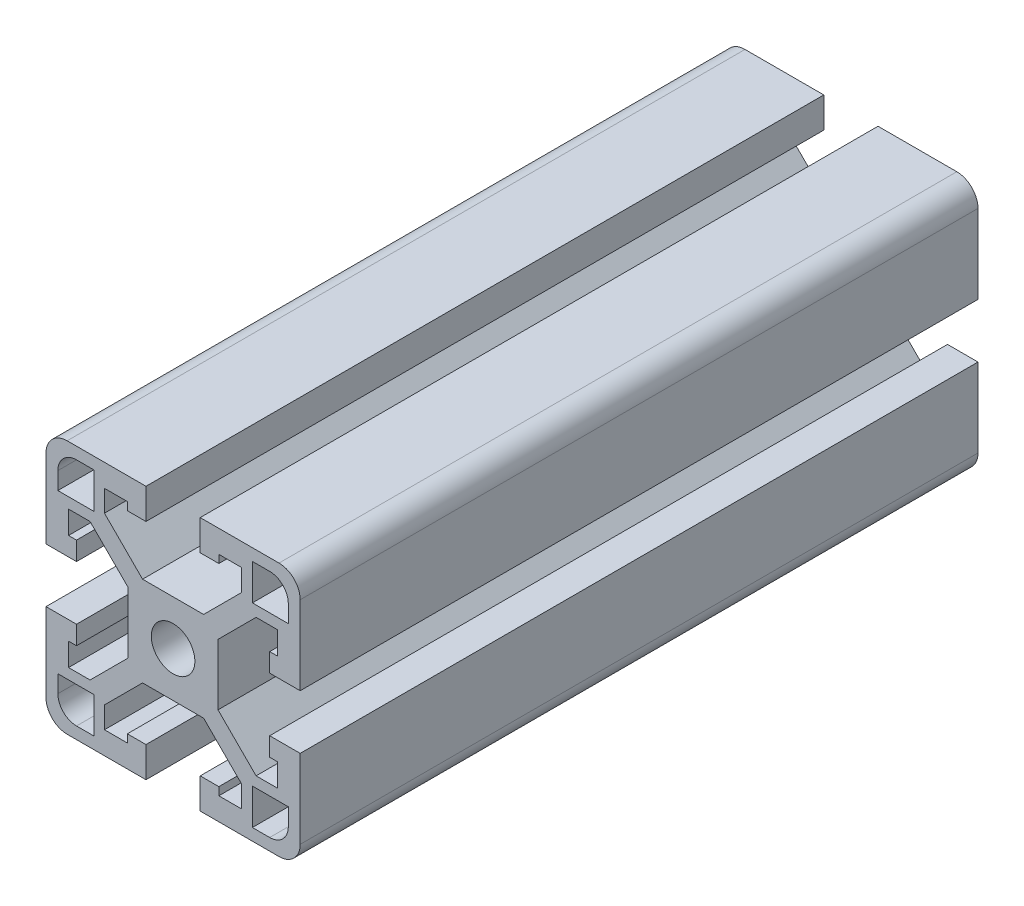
ISO-10303-21;
HEADER;
FILE_DESCRIPTION(('STEP AP214'),'2;1');
FILE_NAME('part.step','',(''),(''),'','','');
FILE_SCHEMA(('AUTOMOTIVE_DESIGN { 1 0 10303 214 1 1 1 1 }'));
ENDSEC;
DATA;
#1=APPLICATION_CONTEXT('core data for automotive mechanical design processes');
#2=APPLICATION_PROTOCOL_DEFINITION('international standard','automotive_design',2000,#1);
#3=PRODUCT_CONTEXT('',#1,'mechanical');
#4=PRODUCT('Part','Part','',(#3));
#5=PRODUCT_RELATED_PRODUCT_CATEGORY('part','',(#4));
#6=PRODUCT_DEFINITION_FORMATION('','',#4);
#7=PRODUCT_DEFINITION_CONTEXT('part definition',#1,'design');
#8=PRODUCT_DEFINITION('design','',#6,#7);
#9=PRODUCT_DEFINITION_SHAPE('','',#8);
#10=(LENGTH_UNIT() NAMED_UNIT(*) SI_UNIT(.MILLI.,.METRE.));
#11=(NAMED_UNIT(*) PLANE_ANGLE_UNIT() SI_UNIT($,.RADIAN.));
#12=(NAMED_UNIT(*) SI_UNIT($,.STERADIAN.) SOLID_ANGLE_UNIT());
#13=UNCERTAINTY_MEASURE_WITH_UNIT(LENGTH_MEASURE(1.E-05),#10,'distance_accuracy_value','');
#14=(GEOMETRIC_REPRESENTATION_CONTEXT(3) GLOBAL_UNCERTAINTY_ASSIGNED_CONTEXT((#13)) GLOBAL_UNIT_ASSIGNED_CONTEXT((#10,
#11,#12)) REPRESENTATION_CONTEXT('',''));
#15=CARTESIAN_POINT('',(0.,0.,0.));
#16=DIRECTION('',(0.,0.,1.));
#17=DIRECTION('',(1.,0.,0.));
#18=AXIS2_PLACEMENT_3D('',#15,#16,#17);
#19=CARTESIAN_POINT('',(-15.875,-15.875,50.8));
#20=DIRECTION('',(0.,0.,1.));
#21=DIRECTION('',(1.,0.,0.));
#22=AXIS2_PLACEMENT_3D('',#19,#20,#21);
#23=PLANE('',#22);
#24=DIRECTION('',(0.707106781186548,-0.707106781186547,0.));
#25=VECTOR('',#24,1.);
#26=CARTESIAN_POINT('',(-12.4422614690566,10.287,50.8));
#27=LINE('',#26,#25);
#28=CARTESIAN_POINT('',(-12.4422614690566,10.287,50.8));
#29=VERTEX_POINT('',#28);
#30=CARTESIAN_POINT('',(-6.731,4.57573853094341,50.8));
#31=VERTEX_POINT('',#30);
#32=EDGE_CURVE('E717',#29,#31,#27,.T.);
#33=ORIENTED_EDGE('',*,*,#32,.T.);
#34=DIRECTION('',(0.,-1.,0.));
#35=VECTOR('',#34,1.);
#36=CARTESIAN_POINT('',(-6.731,4.57573853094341,50.8));
#37=LINE('',#36,#35);
#38=CARTESIAN_POINT('',(-6.731,-4.5757385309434,50.8));
#39=VERTEX_POINT('',#38);
#40=EDGE_CURVE('E720',#31,#39,#37,.T.);
#41=ORIENTED_EDGE('',*,*,#40,.T.);
#42=DIRECTION('',(-0.707106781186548,-0.707106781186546,0.));
#43=VECTOR('',#42,1.);
#44=CARTESIAN_POINT('',(-6.731,-4.5757385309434,50.8));
#45=LINE('',#44,#43);
#46=CARTESIAN_POINT('',(-12.4422614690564,-10.2869999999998,50.8));
#47=VERTEX_POINT('',#46);
#48=EDGE_CURVE('E723',#39,#47,#45,.T.);
#49=ORIENTED_EDGE('',*,*,#48,.T.);
#50=DIRECTION('',(-1.,0.,0.));
#51=VECTOR('',#50,1.);
#52=CARTESIAN_POINT('',(-12.4422614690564,-10.2869999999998,50.8));
#53=LINE('',#52,#51);
#54=CARTESIAN_POINT('',(-15.6718,-10.2869999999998,50.8));
#55=VERTEX_POINT('',#54);
#56=EDGE_CURVE('E725',#47,#55,#53,.T.);
#57=ORIENTED_EDGE('',*,*,#56,.T.);
#58=DIRECTION('',(0.,1.,0.));
#59=VECTOR('',#58,1.);
#60=CARTESIAN_POINT('',(-15.6718,-10.2869999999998,50.8));
#61=LINE('',#60,#59);
#62=CARTESIAN_POINT('',(-15.6718,-6.858,50.8));
#63=VERTEX_POINT('',#62);
#64=EDGE_CURVE('E727',#55,#63,#61,.T.);
#65=ORIENTED_EDGE('',*,*,#64,.T.);
#66=DIRECTION('',(1.,0.,0.));
#67=VECTOR('',#66,1.);
#68=CARTESIAN_POINT('',(-15.6718,-6.858,50.8));
#69=LINE('',#68,#67);
#70=CARTESIAN_POINT('',(-14.478,-6.85799999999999,50.8));
#71=VERTEX_POINT('',#70);
#72=EDGE_CURVE('E729',#63,#71,#69,.T.);
#73=ORIENTED_EDGE('',*,*,#72,.T.);
#74=DIRECTION('',(0.,1.,0.));
#75=VECTOR('',#74,1.);
#76=CARTESIAN_POINT('',(-14.478,-6.85799999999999,50.8));
#77=LINE('',#76,#75);
#78=CARTESIAN_POINT('',(-14.478,-4.064,50.8));
#79=VERTEX_POINT('',#78);
#80=EDGE_CURVE('E731',#71,#79,#77,.T.);
#81=ORIENTED_EDGE('',*,*,#80,.T.);
#82=DIRECTION('',(-1.,0.,0.));
#83=VECTOR('',#82,1.);
#84=CARTESIAN_POINT('',(-14.478,-4.064,50.8));
#85=LINE('',#84,#83);
#86=CARTESIAN_POINT('',(-19.05,-4.06400000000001,50.8));
#87=VERTEX_POINT('',#86);
#88=EDGE_CURVE('E733',#79,#87,#85,.T.);
#89=ORIENTED_EDGE('',*,*,#88,.T.);
#90=DIRECTION('',(0.,-1.,0.));
#91=VECTOR('',#90,1.);
#92=CARTESIAN_POINT('',(-19.05,-4.06400000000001,50.8));
#93=LINE('',#92,#91);
#94=CARTESIAN_POINT('',(-19.05,-15.875,50.8));
#95=VERTEX_POINT('',#94);
#96=EDGE_CURVE('E735',#87,#95,#93,.T.);
#97=ORIENTED_EDGE('',*,*,#96,.T.);
#98=CARTESIAN_POINT('',(-15.875,-15.875,50.8));
#99=DIRECTION('',(0.,0.,1.));
#100=DIRECTION('',(1.,0.,0.));
#101=AXIS2_PLACEMENT_3D('',#98,#99,#100);
#102=CIRCLE('',#101,3.17499999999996);
#103=CARTESIAN_POINT('',(-15.875,-19.05,50.8));
#104=VERTEX_POINT('',#103);
#105=EDGE_CURVE('E737',#95,#104,#102,.T.);
#106=ORIENTED_EDGE('',*,*,#105,.T.);
#107=DIRECTION('',(1.,0.,0.));
#108=VECTOR('',#107,1.);
#109=CARTESIAN_POINT('',(-15.875,-19.05,50.8));
#110=LINE('',#109,#108);
#111=CARTESIAN_POINT('',(-4.064,-19.05,50.8));
#112=VERTEX_POINT('',#111);
#113=EDGE_CURVE('E739',#104,#112,#110,.T.);
#114=ORIENTED_EDGE('',*,*,#113,.T.);
#115=DIRECTION('',(0.,1.,0.));
#116=VECTOR('',#115,1.);
#117=CARTESIAN_POINT('',(-4.064,-19.05,50.8));
#118=LINE('',#117,#116);
#119=CARTESIAN_POINT('',(-4.064,-14.478,50.8));
#120=VERTEX_POINT('',#119);
#121=EDGE_CURVE('E741',#112,#120,#118,.T.);
#122=ORIENTED_EDGE('',*,*,#121,.T.);
#123=DIRECTION('',(-1.,0.,0.));
#124=VECTOR('',#123,1.);
#125=CARTESIAN_POINT('',(-4.064,-14.478,50.8));
#126=LINE('',#125,#124);
#127=CARTESIAN_POINT('',(-6.85799999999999,-14.478,50.8));
#128=VERTEX_POINT('',#127);
#129=EDGE_CURVE('E743',#120,#128,#126,.T.);
#130=ORIENTED_EDGE('',*,*,#129,.T.);
#131=DIRECTION('',(0.,-1.,0.));
#132=VECTOR('',#131,1.);
#133=CARTESIAN_POINT('',(-6.85799999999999,-14.478,50.8));
#134=LINE('',#133,#132);
#135=CARTESIAN_POINT('',(-6.85799999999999,-15.6718,50.8));
#136=VERTEX_POINT('',#135);
#137=EDGE_CURVE('E745',#128,#136,#134,.T.);
#138=ORIENTED_EDGE('',*,*,#137,.T.);
#139=DIRECTION('',(-1.,0.,0.));
#140=VECTOR('',#139,1.);
#141=CARTESIAN_POINT('',(-6.85799999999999,-15.6718,50.8));
#142=LINE('',#141,#140);
#143=CARTESIAN_POINT('',(-10.2869999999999,-15.6718,50.8));
#144=VERTEX_POINT('',#143);
#145=EDGE_CURVE('E747',#136,#144,#142,.T.);
#146=ORIENTED_EDGE('',*,*,#145,.T.);
#147=DIRECTION('',(0.,1.,0.));
#148=VECTOR('',#147,1.);
#149=CARTESIAN_POINT('',(-10.2869999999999,-15.6718,50.8));
#150=LINE('',#149,#148);
#151=CARTESIAN_POINT('',(-10.2869999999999,-12.4422614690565,50.8));
#152=VERTEX_POINT('',#151);
#153=EDGE_CURVE('E749',#144,#152,#150,.T.);
#154=ORIENTED_EDGE('',*,*,#153,.T.);
#155=DIRECTION('',(0.707106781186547,0.707106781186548,0.));
#156=VECTOR('',#155,1.);
#157=CARTESIAN_POINT('',(-10.2869999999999,-12.4422614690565,50.8));
#158=LINE('',#157,#156);
#159=CARTESIAN_POINT('',(-4.57573853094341,-6.73100000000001,50.8));
#160=VERTEX_POINT('',#159);
#161=EDGE_CURVE('E751',#152,#160,#158,.T.);
#162=ORIENTED_EDGE('',*,*,#161,.T.);
#163=DIRECTION('',(1.,0.,0.));
#164=VECTOR('',#163,1.);
#165=CARTESIAN_POINT('',(-4.57573853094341,-6.73100000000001,50.8));
#166=LINE('',#165,#164);
#167=CARTESIAN_POINT('',(4.57573853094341,-6.73100000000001,50.8));
#168=VERTEX_POINT('',#167);
#169=EDGE_CURVE('E753',#160,#168,#166,.T.);
#170=ORIENTED_EDGE('',*,*,#169,.T.);
#171=DIRECTION('',(0.707106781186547,-0.707106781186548,0.));
#172=VECTOR('',#171,1.);
#173=CARTESIAN_POINT('',(4.57573853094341,-6.73100000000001,50.8));
#174=LINE('',#173,#172);
#175=CARTESIAN_POINT('',(10.2869999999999,-12.4422614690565,50.8));
#176=VERTEX_POINT('',#175);
#177=EDGE_CURVE('E755',#168,#176,#174,.T.);
#178=ORIENTED_EDGE('',*,*,#177,.T.);
#179=DIRECTION('',(0.,-1.,0.));
#180=VECTOR('',#179,1.);
#181=CARTESIAN_POINT('',(10.2869999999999,-12.4422614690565,50.8));
#182=LINE('',#181,#180);
#183=CARTESIAN_POINT('',(10.2869999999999,-15.6718,50.8));
#184=VERTEX_POINT('',#183);
#185=EDGE_CURVE('E757',#176,#184,#182,.T.);
#186=ORIENTED_EDGE('',*,*,#185,.T.);
#187=DIRECTION('',(-1.,0.,0.));
#188=VECTOR('',#187,1.);
#189=CARTESIAN_POINT('',(10.2869999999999,-15.6718,50.8));
#190=LINE('',#189,#188);
#191=CARTESIAN_POINT('',(6.85800000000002,-15.6718,50.8));
#192=VERTEX_POINT('',#191);
#193=EDGE_CURVE('E759',#184,#192,#190,.T.);
#194=ORIENTED_EDGE('',*,*,#193,.T.);
#195=DIRECTION('',(0.,1.,0.));
#196=VECTOR('',#195,1.);
#197=CARTESIAN_POINT('',(6.85800000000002,-15.6718,50.8));
#198=LINE('',#197,#196);
#199=CARTESIAN_POINT('',(6.85800000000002,-14.478,50.8));
#200=VERTEX_POINT('',#199);
#201=EDGE_CURVE('E761',#192,#200,#198,.T.);
#202=ORIENTED_EDGE('',*,*,#201,.T.);
#203=DIRECTION('',(-1.,0.,0.));
#204=VECTOR('',#203,1.);
#205=CARTESIAN_POINT('',(6.85800000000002,-14.478,50.8));
#206=LINE('',#205,#204);
#207=CARTESIAN_POINT('',(4.06400000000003,-14.478,50.8));
#208=VERTEX_POINT('',#207);
#209=EDGE_CURVE('E763',#200,#208,#206,.T.);
#210=ORIENTED_EDGE('',*,*,#209,.T.);
#211=DIRECTION('',(0.,-1.,0.));
#212=VECTOR('',#211,1.);
#213=CARTESIAN_POINT('',(4.06400000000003,-14.478,50.8));
#214=LINE('',#213,#212);
#215=CARTESIAN_POINT('',(4.06400000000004,-19.05,50.8));
#216=VERTEX_POINT('',#215);
#217=EDGE_CURVE('E765',#208,#216,#214,.T.);
#218=ORIENTED_EDGE('',*,*,#217,.T.);
#219=DIRECTION('',(1.,0.,0.));
#220=VECTOR('',#219,1.);
#221=CARTESIAN_POINT('',(4.06400000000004,-19.05,50.8));
#222=LINE('',#221,#220);
#223=CARTESIAN_POINT('',(15.8750000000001,-19.05,50.8));
#224=VERTEX_POINT('',#223);
#225=EDGE_CURVE('E767',#216,#224,#222,.T.);
#226=ORIENTED_EDGE('',*,*,#225,.T.);
#227=CARTESIAN_POINT('',(15.8750000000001,-15.875,50.8));
#228=DIRECTION('',(0.,0.,1.));
#229=DIRECTION('',(1.,0.,0.));
#230=AXIS2_PLACEMENT_3D('',#227,#228,#229);
#231=CIRCLE('',#230,3.17499999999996);
#232=CARTESIAN_POINT('',(19.05,-15.875,50.8));
#233=VERTEX_POINT('',#232);
#234=EDGE_CURVE('E769',#224,#233,#231,.T.);
#235=ORIENTED_EDGE('',*,*,#234,.T.);
#236=DIRECTION('',(0.,1.,0.));
#237=VECTOR('',#236,1.);
#238=CARTESIAN_POINT('',(19.05,-15.875,50.8));
#239=LINE('',#238,#237);
#240=CARTESIAN_POINT('',(19.05,-4.064,50.8));
#241=VERTEX_POINT('',#240);
#242=EDGE_CURVE('E771',#233,#241,#239,.T.);
#243=ORIENTED_EDGE('',*,*,#242,.T.);
#244=DIRECTION('',(-1.,0.,0.));
#245=VECTOR('',#244,1.);
#246=CARTESIAN_POINT('',(19.05,-4.064,50.8));
#247=LINE('',#246,#245);
#248=CARTESIAN_POINT('',(14.478,-4.064,50.8));
#249=VERTEX_POINT('',#248);
#250=EDGE_CURVE('E773',#241,#249,#247,.T.);
#251=ORIENTED_EDGE('',*,*,#250,.T.);
#252=DIRECTION('',(0.,-1.,0.));
#253=VECTOR('',#252,1.);
#254=CARTESIAN_POINT('',(14.478,-4.064,50.8));
#255=LINE('',#254,#253);
#256=CARTESIAN_POINT('',(14.478,-6.85799999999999,50.8));
#257=VERTEX_POINT('',#256);
#258=EDGE_CURVE('E775',#249,#257,#255,.T.);
#259=ORIENTED_EDGE('',*,*,#258,.T.);
#260=DIRECTION('',(1.,0.,0.));
#261=VECTOR('',#260,1.);
#262=CARTESIAN_POINT('',(14.478,-6.85799999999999,50.8));
#263=LINE('',#262,#261);
#264=CARTESIAN_POINT('',(15.6718,-6.85799999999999,50.8));
#265=VERTEX_POINT('',#264);
#266=EDGE_CURVE('E777',#257,#265,#263,.T.);
#267=ORIENTED_EDGE('',*,*,#266,.T.);
#268=DIRECTION('',(0.,-1.,0.));
#269=VECTOR('',#268,1.);
#270=CARTESIAN_POINT('',(15.6718,-6.85799999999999,50.8));
#271=LINE('',#270,#269);
#272=CARTESIAN_POINT('',(15.6718,-10.2869999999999,50.8));
#273=VERTEX_POINT('',#272);
#274=EDGE_CURVE('E779',#265,#273,#271,.T.);
#275=ORIENTED_EDGE('',*,*,#274,.T.);
#276=DIRECTION('',(-1.,0.,0.));
#277=VECTOR('',#276,1.);
#278=CARTESIAN_POINT('',(15.6718,-10.2869999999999,50.8));
#279=LINE('',#278,#277);
#280=CARTESIAN_POINT('',(12.4422614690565,-10.2869999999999,50.8));
#281=VERTEX_POINT('',#280);
#282=EDGE_CURVE('E781',#273,#281,#279,.T.);
#283=ORIENTED_EDGE('',*,*,#282,.T.);
#284=DIRECTION('',(-0.707106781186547,0.707106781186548,0.));
#285=VECTOR('',#284,1.);
#286=CARTESIAN_POINT('',(12.4422614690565,-10.2869999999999,50.8));
#287=LINE('',#286,#285);
#288=CARTESIAN_POINT('',(6.73100000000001,-4.57573853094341,50.8));
#289=VERTEX_POINT('',#288);
#290=EDGE_CURVE('E783',#281,#289,#287,.T.);
#291=ORIENTED_EDGE('',*,*,#290,.T.);
#292=DIRECTION('',(0.,1.,0.));
#293=VECTOR('',#292,1.);
#294=CARTESIAN_POINT('',(6.73100000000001,-4.57573853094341,50.8));
#295=LINE('',#294,#293);
#296=CARTESIAN_POINT('',(6.73100000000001,4.5757385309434,50.8));
#297=VERTEX_POINT('',#296);
#298=EDGE_CURVE('E785',#289,#297,#295,.T.);
#299=ORIENTED_EDGE('',*,*,#298,.T.);
#300=DIRECTION('',(0.707106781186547,0.707106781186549,0.));
#301=VECTOR('',#300,1.);
#302=CARTESIAN_POINT('',(6.73100000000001,4.5757385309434,50.8));
#303=LINE('',#302,#301);
#304=CARTESIAN_POINT('',(12.4422614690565,10.2869999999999,50.8));
#305=VERTEX_POINT('',#304);
#306=EDGE_CURVE('E787',#297,#305,#303,.T.);
#307=ORIENTED_EDGE('',*,*,#306,.T.);
#308=DIRECTION('',(1.,0.,0.));
#309=VECTOR('',#308,1.);
#310=CARTESIAN_POINT('',(12.4422614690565,10.2869999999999,50.8));
#311=LINE('',#310,#309);
#312=CARTESIAN_POINT('',(15.6718,10.2870000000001,50.8));
#313=VERTEX_POINT('',#312);
#314=EDGE_CURVE('E789',#305,#313,#311,.T.);
#315=ORIENTED_EDGE('',*,*,#314,.T.);
#316=DIRECTION('',(0.,-1.,0.));
#317=VECTOR('',#316,1.);
#318=CARTESIAN_POINT('',(15.6718,10.2870000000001,50.8));
#319=LINE('',#318,#317);
#320=CARTESIAN_POINT('',(15.6718,6.858,50.8));
#321=VERTEX_POINT('',#320);
#322=EDGE_CURVE('E791',#313,#321,#319,.T.);
#323=ORIENTED_EDGE('',*,*,#322,.T.);
#324=DIRECTION('',(-1.,-1.48217284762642E-13,0.));
#325=VECTOR('',#324,1.);
#326=CARTESIAN_POINT('',(15.6718,6.858,50.8));
#327=LINE('',#326,#325);
#328=CARTESIAN_POINT('',(14.4780000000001,6.85799999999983,50.8));
#329=VERTEX_POINT('',#328);
#330=EDGE_CURVE('E793',#321,#329,#327,.T.);
#331=ORIENTED_EDGE('',*,*,#330,.T.);
#332=DIRECTION('',(0.,-1.,0.));
#333=VECTOR('',#332,1.);
#334=CARTESIAN_POINT('',(14.4780000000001,6.85799999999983,50.8));
#335=LINE('',#334,#333);
#336=CARTESIAN_POINT('',(14.4780000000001,4.06399999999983,50.8));
#337=VERTEX_POINT('',#336);
#338=EDGE_CURVE('E795',#329,#337,#335,.T.);
#339=ORIENTED_EDGE('',*,*,#338,.T.);
#340=DIRECTION('',(1.,0.,0.));
#341=VECTOR('',#340,1.);
#342=CARTESIAN_POINT('',(14.4780000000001,4.06399999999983,50.8));
#343=LINE('',#342,#341);
#344=CARTESIAN_POINT('',(19.05,4.06399999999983,50.8));
#345=VERTEX_POINT('',#344);
#346=EDGE_CURVE('E797',#337,#345,#343,.T.);
#347=ORIENTED_EDGE('',*,*,#346,.T.);
#348=DIRECTION('',(0.,1.,0.));
#349=VECTOR('',#348,1.);
#350=CARTESIAN_POINT('',(19.05,4.06399999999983,50.8));
#351=LINE('',#350,#349);
#352=CARTESIAN_POINT('',(19.05,15.8750000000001,50.8));
#353=VERTEX_POINT('',#352);
#354=EDGE_CURVE('E799',#345,#353,#351,.T.);
#355=ORIENTED_EDGE('',*,*,#354,.T.);
#356=CARTESIAN_POINT('',(15.8750000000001,15.8750000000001,50.8));
#357=DIRECTION('',(0.,0.,1.));
#358=DIRECTION('',(1.,0.,0.));
#359=AXIS2_PLACEMENT_3D('',#356,#357,#358);
#360=CIRCLE('',#359,3.17499999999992);
#361=CARTESIAN_POINT('',(15.875,19.05,50.8));
#362=VERTEX_POINT('',#361);
#363=EDGE_CURVE('E801',#353,#362,#360,.T.);
#364=ORIENTED_EDGE('',*,*,#363,.T.);
#365=DIRECTION('',(-1.,0.,0.));
#366=VECTOR('',#365,1.);
#367=CARTESIAN_POINT('',(15.875,19.05,50.8));
#368=LINE('',#367,#366);
#369=CARTESIAN_POINT('',(4.06399999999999,19.05,50.8));
#370=VERTEX_POINT('',#369);
#371=EDGE_CURVE('E803',#362,#370,#368,.T.);
#372=ORIENTED_EDGE('',*,*,#371,.T.);
#373=DIRECTION('',(0.,-1.,0.));
#374=VECTOR('',#373,1.);
#375=CARTESIAN_POINT('',(4.06399999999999,19.05,50.8));
#376=LINE('',#375,#374);
#377=CARTESIAN_POINT('',(4.06399999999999,14.478,50.8));
#378=VERTEX_POINT('',#377);
#379=EDGE_CURVE('E805',#370,#378,#376,.T.);
#380=ORIENTED_EDGE('',*,*,#379,.T.);
#381=DIRECTION('',(1.,0.,0.));
#382=VECTOR('',#381,1.);
#383=CARTESIAN_POINT('',(4.06399999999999,14.478,50.8));
#384=LINE('',#383,#382);
#385=CARTESIAN_POINT('',(6.85799999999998,14.478,50.8));
#386=VERTEX_POINT('',#385);
#387=EDGE_CURVE('E807',#378,#386,#384,.T.);
#388=ORIENTED_EDGE('',*,*,#387,.T.);
#389=DIRECTION('',(0.,1.,0.));
#390=VECTOR('',#389,1.);
#391=CARTESIAN_POINT('',(6.85799999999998,14.478,50.8));
#392=LINE('',#391,#390);
#393=CARTESIAN_POINT('',(6.85799999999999,15.6718000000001,50.8));
#394=VERTEX_POINT('',#393);
#395=EDGE_CURVE('E809',#386,#394,#392,.T.);
#396=ORIENTED_EDGE('',*,*,#395,.T.);
#397=DIRECTION('',(1.,0.,0.));
#398=VECTOR('',#397,1.);
#399=CARTESIAN_POINT('',(6.85799999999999,15.6718000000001,50.8));
#400=LINE('',#399,#398);
#401=CARTESIAN_POINT('',(10.2869999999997,15.6718000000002,50.8));
#402=VERTEX_POINT('',#401);
#403=EDGE_CURVE('E811',#394,#402,#400,.T.);
#404=ORIENTED_EDGE('',*,*,#403,.T.);
#405=DIRECTION('',(0.,-1.,0.));
#406=VECTOR('',#405,1.);
#407=CARTESIAN_POINT('',(10.2869999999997,15.6718000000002,50.8));
#408=LINE('',#407,#406);
#409=CARTESIAN_POINT('',(10.2869999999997,12.4422614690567,50.8));
#410=VERTEX_POINT('',#409);
#411=EDGE_CURVE('E813',#402,#410,#408,.T.);
#412=ORIENTED_EDGE('',*,*,#411,.T.);
#413=DIRECTION('',(-0.707106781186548,-0.707106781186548,0.));
#414=VECTOR('',#413,1.);
#415=CARTESIAN_POINT('',(10.2869999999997,12.4422614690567,50.8));
#416=LINE('',#415,#414);
#417=CARTESIAN_POINT('',(4.57573853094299,6.73100000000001,50.8));
#418=VERTEX_POINT('',#417);
#419=EDGE_CURVE('E815',#410,#418,#416,.T.);
#420=ORIENTED_EDGE('',*,*,#419,.T.);
#421=DIRECTION('',(-1.,0.,0.));
#422=VECTOR('',#421,1.);
#423=CARTESIAN_POINT('',(4.57573853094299,6.73100000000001,50.8));
#424=LINE('',#423,#422);
#425=CARTESIAN_POINT('',(-4.57573853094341,6.73100000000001,50.8));
#426=VERTEX_POINT('',#425);
#427=EDGE_CURVE('E817',#418,#426,#424,.T.);
#428=ORIENTED_EDGE('',*,*,#427,.T.);
#429=DIRECTION('',(-0.707106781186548,0.707106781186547,0.));
#430=VECTOR('',#429,1.);
#431=CARTESIAN_POINT('',(-4.57573853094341,6.73100000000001,50.8));
#432=LINE('',#431,#430);
#433=CARTESIAN_POINT('',(-10.287,12.4422614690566,50.8));
#434=VERTEX_POINT('',#433);
#435=EDGE_CURVE('E819',#426,#434,#432,.T.);
#436=ORIENTED_EDGE('',*,*,#435,.T.);
#437=DIRECTION('',(0.,1.,0.));
#438=VECTOR('',#437,1.);
#439=CARTESIAN_POINT('',(-10.287,12.4422614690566,50.8));
#440=LINE('',#439,#438);
#441=CARTESIAN_POINT('',(-10.287,15.6718,50.8));
#442=VERTEX_POINT('',#441);
#443=EDGE_CURVE('E821',#434,#442,#440,.T.);
#444=ORIENTED_EDGE('',*,*,#443,.T.);
#445=DIRECTION('',(1.,0.,0.));
#446=VECTOR('',#445,1.);
#447=CARTESIAN_POINT('',(-10.287,15.6718,50.8));
#448=LINE('',#447,#446);
#449=CARTESIAN_POINT('',(-6.858,15.6718,50.8));
#450=VERTEX_POINT('',#449);
#451=EDGE_CURVE('E823',#442,#450,#448,.T.);
#452=ORIENTED_EDGE('',*,*,#451,.T.);
#453=DIRECTION('',(0.,-1.,0.));
#454=VECTOR('',#453,1.);
#455=CARTESIAN_POINT('',(-6.858,15.6718,50.8));
#456=LINE('',#455,#454);
#457=CARTESIAN_POINT('',(-6.858,14.478,50.8));
#458=VERTEX_POINT('',#457);
#459=EDGE_CURVE('E825',#450,#458,#456,.T.);
#460=ORIENTED_EDGE('',*,*,#459,.T.);
#461=DIRECTION('',(1.,0.,0.));
#462=VECTOR('',#461,1.);
#463=CARTESIAN_POINT('',(-6.858,14.478,50.8));
#464=LINE('',#463,#462);
#465=CARTESIAN_POINT('',(-4.064,14.478,50.8));
#466=VERTEX_POINT('',#465);
#467=EDGE_CURVE('E827',#458,#466,#464,.T.);
#468=ORIENTED_EDGE('',*,*,#467,.T.);
#469=DIRECTION('',(0.,1.,0.));
#470=VECTOR('',#469,1.);
#471=CARTESIAN_POINT('',(-4.064,14.478,50.8));
#472=LINE('',#471,#470);
#473=CARTESIAN_POINT('',(-4.06400000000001,19.05,50.8));
#474=VERTEX_POINT('',#473);
#475=EDGE_CURVE('E829',#466,#474,#472,.T.);
#476=ORIENTED_EDGE('',*,*,#475,.T.);
#477=DIRECTION('',(-1.,0.,0.));
#478=VECTOR('',#477,1.);
#479=CARTESIAN_POINT('',(-4.06400000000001,19.05,50.8));
#480=LINE('',#479,#478);
#481=CARTESIAN_POINT('',(-15.875,19.05,50.8));
#482=VERTEX_POINT('',#481);
#483=EDGE_CURVE('E831',#474,#482,#480,.T.);
#484=ORIENTED_EDGE('',*,*,#483,.T.);
#485=CARTESIAN_POINT('',(-15.875,15.875,50.8));
#486=DIRECTION('',(0.,0.,1.));
#487=DIRECTION('',(1.,0.,0.));
#488=AXIS2_PLACEMENT_3D('',#485,#486,#487);
#489=CIRCLE('',#488,3.17499999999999);
#490=CARTESIAN_POINT('',(-19.05,15.875,50.8));
#491=VERTEX_POINT('',#490);
#492=EDGE_CURVE('E833',#482,#491,#489,.T.);
#493=ORIENTED_EDGE('',*,*,#492,.T.);
#494=DIRECTION('',(0.,-1.,0.));
#495=VECTOR('',#494,1.);
#496=CARTESIAN_POINT('',(-19.05,15.875,50.8));
#497=LINE('',#496,#495);
#498=CARTESIAN_POINT('',(-19.05,4.06400000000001,50.8));
#499=VERTEX_POINT('',#498);
#500=EDGE_CURVE('E835',#491,#499,#497,.T.);
#501=ORIENTED_EDGE('',*,*,#500,.T.);
#502=DIRECTION('',(1.,0.,0.));
#503=VECTOR('',#502,1.);
#504=CARTESIAN_POINT('',(-19.05,4.06400000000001,50.8));
#505=LINE('',#504,#503);
#506=CARTESIAN_POINT('',(-14.478,4.06400000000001,50.8));
#507=VERTEX_POINT('',#506);
#508=EDGE_CURVE('E837',#499,#507,#505,.T.);
#509=ORIENTED_EDGE('',*,*,#508,.T.);
#510=DIRECTION('',(0.,1.,0.));
#511=VECTOR('',#510,1.);
#512=CARTESIAN_POINT('',(-14.478,4.06400000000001,50.8));
#513=LINE('',#512,#511);
#514=CARTESIAN_POINT('',(-14.478,6.85800000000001,50.8));
#515=VERTEX_POINT('',#514);
#516=EDGE_CURVE('E839',#507,#515,#513,.T.);
#517=ORIENTED_EDGE('',*,*,#516,.T.);
#518=DIRECTION('',(-1.,0.,0.));
#519=VECTOR('',#518,1.);
#520=CARTESIAN_POINT('',(-14.478,6.85800000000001,50.8));
#521=LINE('',#520,#519);
#522=CARTESIAN_POINT('',(-15.6718,6.85800000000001,50.8));
#523=VERTEX_POINT('',#522);
#524=EDGE_CURVE('E841',#515,#523,#521,.T.);
#525=ORIENTED_EDGE('',*,*,#524,.T.);
#526=DIRECTION('',(0.,1.,0.));
#527=VECTOR('',#526,1.);
#528=CARTESIAN_POINT('',(-15.6718,6.85800000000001,50.8));
#529=LINE('',#528,#527);
#530=CARTESIAN_POINT('',(-15.6718,10.2870000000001,50.8));
#531=VERTEX_POINT('',#530);
#532=EDGE_CURVE('E843',#523,#531,#529,.T.);
#533=ORIENTED_EDGE('',*,*,#532,.T.);
#534=DIRECTION('',(1.,0.,0.));
#535=VECTOR('',#534,1.);
#536=CARTESIAN_POINT('',(-15.6718,10.2870000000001,50.8));
#537=LINE('',#536,#535);
#538=EDGE_CURVE('E845',#531,#29,#537,.T.);
#539=ORIENTED_EDGE('',*,*,#538,.T.);
#540=EDGE_LOOP('',(#33,#41,#49,#57,#65,#73,#81,#89,#97,#106,#114,#122,#130,#138,#146,#154,#162,
#170,#178,#186,#194,#202,#210,#218,#226,#235,#243,#251,#259,#267,#275,#283,#291,#299,#307,#315,
#323,#331,#339,#347,#355,#364,#372,#380,#388,#396,#404,#412,#420,#428,#436,#444,#452,#460,#468,
#476,#484,#493,#501,#509,#517,#525,#533,#539));
#541=FACE_BOUND('',#540,.T.);
#542=CARTESIAN_POINT('',(0.,0.,50.8));
#543=DIRECTION('',(0.,0.,1.));
#544=DIRECTION('',(1.,0.,0.));
#545=AXIS2_PLACEMENT_3D('',#542,#543,#544);
#546=CIRCLE('',#545,3.26390000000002);
#547=CARTESIAN_POINT('',(3.26390000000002,0.,50.8));
#548=VERTEX_POINT('',#547);
#549=EDGE_CURVE('E711',#548,#548,#546,.T.);
#550=ORIENTED_EDGE('',*,*,#549,.F.);
#551=EDGE_LOOP('',(#550));
#552=FACE_BOUND('',#551,.T.);
#553=DIRECTION('',(0.,-1.,0.));
#554=VECTOR('',#553,1.);
#555=CARTESIAN_POINT('',(-17.272,14.478,50.8));
#556=LINE('',#555,#554);
#557=CARTESIAN_POINT('',(-17.272,14.478,50.8));
#558=VERTEX_POINT('',#557);
#559=CARTESIAN_POINT('',(-17.272,11.8872,50.8));
#560=VERTEX_POINT('',#559);
#561=EDGE_CURVE('E675',#558,#560,#556,.T.);
#562=ORIENTED_EDGE('',*,*,#561,.F.);
#563=CARTESIAN_POINT('',(-14.478,14.478,50.8));
#564=DIRECTION('',(0.,0.,1.));
#565=DIRECTION('',(1.,0.,0.));
#566=AXIS2_PLACEMENT_3D('',#563,#564,#565);
#567=CIRCLE('',#566,2.794);
#568=CARTESIAN_POINT('',(-14.478,17.272,50.8));
#569=VERTEX_POINT('',#568);
#570=EDGE_CURVE('E673',#569,#558,#567,.T.);
#571=ORIENTED_EDGE('',*,*,#570,.F.);
#572=DIRECTION('',(-1.,0.,0.));
#573=VECTOR('',#572,1.);
#574=CARTESIAN_POINT('',(-11.8872,17.272,50.8));
#575=LINE('',#574,#573);
#576=CARTESIAN_POINT('',(-11.8872,17.272,50.8));
#577=VERTEX_POINT('',#576);
#578=EDGE_CURVE('E683',#577,#569,#575,.T.);
#579=ORIENTED_EDGE('',*,*,#578,.F.);
#580=DIRECTION('',(0.,1.,0.));
#581=VECTOR('',#580,1.);
#582=CARTESIAN_POINT('',(-11.8872,11.8872,50.8));
#583=LINE('',#582,#581);
#584=CARTESIAN_POINT('',(-11.8872,11.8872,50.8));
#585=VERTEX_POINT('',#584);
#586=EDGE_CURVE('E680',#585,#577,#583,.T.);
#587=ORIENTED_EDGE('',*,*,#586,.F.);
#588=DIRECTION('',(1.,0.,0.));
#589=VECTOR('',#588,1.);
#590=CARTESIAN_POINT('',(-17.272,11.8872,50.8));
#591=LINE('',#590,#589);
#592=EDGE_CURVE('E678',#560,#585,#591,.T.);
#593=ORIENTED_EDGE('',*,*,#592,.F.);
#594=EDGE_LOOP('',(#562,#571,#579,#587,#593));
#595=FACE_BOUND('',#594,.T.);
#596=DIRECTION('',(1.,0.,0.));
#597=VECTOR('',#596,1.);
#598=CARTESIAN_POINT('',(11.8872,11.8872,50.8));
#599=LINE('',#598,#597);
#600=CARTESIAN_POINT('',(11.8872,11.8872,50.8));
#601=VERTEX_POINT('',#600);
#602=CARTESIAN_POINT('',(17.272,11.8872,50.8));
#603=VERTEX_POINT('',#602);
#604=EDGE_CURVE('E637',#601,#603,#599,.T.);
#605=ORIENTED_EDGE('',*,*,#604,.F.);
#606=DIRECTION('',(0.,-1.,0.));
#607=VECTOR('',#606,1.);
#608=CARTESIAN_POINT('',(11.8872,17.272,50.8));
#609=LINE('',#608,#607);
#610=CARTESIAN_POINT('',(11.8872,17.272,50.8));
#611=VERTEX_POINT('',#610);
#612=EDGE_CURVE('E635',#611,#601,#609,.T.);
#613=ORIENTED_EDGE('',*,*,#612,.F.);
#614=DIRECTION('',(-1.,0.,0.));
#615=VECTOR('',#614,1.);
#616=CARTESIAN_POINT('',(14.478,17.272,50.8));
#617=LINE('',#616,#615);
#618=CARTESIAN_POINT('',(14.478,17.272,50.8));
#619=VERTEX_POINT('',#618);
#620=EDGE_CURVE('E645',#619,#611,#617,.T.);
#621=ORIENTED_EDGE('',*,*,#620,.F.);
#622=CARTESIAN_POINT('',(14.478,14.478,50.8));
#623=DIRECTION('',(0.,0.,1.));
#624=DIRECTION('',(1.,0.,0.));
#625=AXIS2_PLACEMENT_3D('',#622,#623,#624);
#626=CIRCLE('',#625,2.794);
#627=CARTESIAN_POINT('',(17.272,14.478,50.8));
#628=VERTEX_POINT('',#627);
#629=EDGE_CURVE('E642',#628,#619,#626,.T.);
#630=ORIENTED_EDGE('',*,*,#629,.F.);
#631=DIRECTION('',(0.,1.,0.));
#632=VECTOR('',#631,1.);
#633=CARTESIAN_POINT('',(17.272,11.8872,50.8));
#634=LINE('',#633,#632);
#635=EDGE_CURVE('E640',#603,#628,#634,.T.);
#636=ORIENTED_EDGE('',*,*,#635,.F.);
#637=EDGE_LOOP('',(#605,#613,#621,#630,#636));
#638=FACE_BOUND('',#637,.T.);
#639=DIRECTION('',(0.,1.,0.));
#640=VECTOR('',#639,1.);
#641=CARTESIAN_POINT('',(17.272,-14.478,50.8));
#642=LINE('',#641,#640);
#643=CARTESIAN_POINT('',(17.272,-14.478,50.8));
#644=VERTEX_POINT('',#643);
#645=CARTESIAN_POINT('',(17.272,-11.8872,50.8));
#646=VERTEX_POINT('',#645);
#647=EDGE_CURVE('E599',#644,#646,#642,.T.);
#648=ORIENTED_EDGE('',*,*,#647,.F.);
#649=CARTESIAN_POINT('',(14.478,-14.478,50.8));
#650=DIRECTION('',(0.,0.,1.));
#651=DIRECTION('',(1.,0.,0.));
#652=AXIS2_PLACEMENT_3D('',#649,#650,#651);
#653=CIRCLE('',#652,2.794);
#654=CARTESIAN_POINT('',(14.478,-17.272,50.8));
#655=VERTEX_POINT('',#654);
#656=EDGE_CURVE('E597',#655,#644,#653,.T.);
#657=ORIENTED_EDGE('',*,*,#656,.F.);
#658=DIRECTION('',(1.,0.,0.));
#659=VECTOR('',#658,1.);
#660=CARTESIAN_POINT('',(11.8872,-17.272,50.8));
#661=LINE('',#660,#659);
#662=CARTESIAN_POINT('',(11.8872,-17.272,50.8));
#663=VERTEX_POINT('',#662);
#664=EDGE_CURVE('E607',#663,#655,#661,.T.);
#665=ORIENTED_EDGE('',*,*,#664,.F.);
#666=DIRECTION('',(0.,-1.,0.));
#667=VECTOR('',#666,1.);
#668=CARTESIAN_POINT('',(11.8872,-11.8872,50.8));
#669=LINE('',#668,#667);
#670=CARTESIAN_POINT('',(11.8872,-11.8872,50.8));
#671=VERTEX_POINT('',#670);
#672=EDGE_CURVE('E604',#671,#663,#669,.T.);
#673=ORIENTED_EDGE('',*,*,#672,.F.);
#674=DIRECTION('',(-1.,0.,0.));
#675=VECTOR('',#674,1.);
#676=CARTESIAN_POINT('',(17.272,-11.8872,50.8));
#677=LINE('',#676,#675);
#678=EDGE_CURVE('E602',#646,#671,#677,.T.);
#679=ORIENTED_EDGE('',*,*,#678,.F.);
#680=EDGE_LOOP('',(#648,#657,#665,#673,#679));
#681=FACE_BOUND('',#680,.T.);
#682=DIRECTION('',(-1.,0.,0.));
#683=VECTOR('',#682,1.);
#684=CARTESIAN_POINT('',(-11.8872,-11.8872,50.8));
#685=LINE('',#684,#683);
#686=CARTESIAN_POINT('',(-11.8872,-11.8872,50.8));
#687=VERTEX_POINT('',#686);
#688=CARTESIAN_POINT('',(-17.272,-11.8872,50.8));
#689=VERTEX_POINT('',#688);
#690=EDGE_CURVE('E561',#687,#689,#685,.T.);
#691=ORIENTED_EDGE('',*,*,#690,.F.);
#692=DIRECTION('',(0.,1.,0.));
#693=VECTOR('',#692,1.);
#694=CARTESIAN_POINT('',(-11.8872,-17.272,50.8));
#695=LINE('',#694,#693);
#696=CARTESIAN_POINT('',(-11.8872,-17.272,50.8));
#697=VERTEX_POINT('',#696);
#698=EDGE_CURVE('E553',#697,#687,#695,.T.);
#699=ORIENTED_EDGE('',*,*,#698,.F.);
#700=DIRECTION('',(1.,0.,0.));
#701=VECTOR('',#700,1.);
#702=CARTESIAN_POINT('',(-14.478,-17.272,50.8));
#703=LINE('',#702,#701);
#704=CARTESIAN_POINT('',(-14.478,-17.272,50.8));
#705=VERTEX_POINT('',#704);
#706=EDGE_CURVE('E580',#705,#697,#703,.T.);
#707=ORIENTED_EDGE('',*,*,#706,.F.);
#708=CARTESIAN_POINT('',(-14.478,-14.478,50.8));
#709=DIRECTION('',(0.,0.,1.));
#710=DIRECTION('',(1.,0.,0.));
#711=AXIS2_PLACEMENT_3D('',#708,#709,#710);
#712=CIRCLE('',#711,2.794);
#713=CARTESIAN_POINT('',(-17.272,-14.478,50.8));
#714=VERTEX_POINT('',#713);
#715=EDGE_CURVE('E576',#714,#705,#712,.T.);
#716=ORIENTED_EDGE('',*,*,#715,.F.);
#717=DIRECTION('',(0.,-1.,0.));
#718=VECTOR('',#717,1.);
#719=CARTESIAN_POINT('',(-17.272,-11.8872,50.8));
#720=LINE('',#719,#718);
#721=EDGE_CURVE('E574',#689,#714,#720,.T.);
#722=ORIENTED_EDGE('',*,*,#721,.F.);
#723=EDGE_LOOP('',(#691,#699,#707,#716,#722));
#724=FACE_BOUND('',#723,.T.);
#725=ADVANCED_FACE('F32',(#541,#552,#595,#638,#681,#724),#23,.T.);
#726=CARTESIAN_POINT('',(-15.875,-15.875,-50.8));
#727=DIRECTION('',(0.,0.,1.));
#728=DIRECTION('',(1.,0.,0.));
#729=AXIS2_PLACEMENT_3D('',#726,#727,#728);
#730=PLANE('',#729);
#731=CARTESIAN_POINT('',(14.478,-14.478,-50.8));
#732=DIRECTION('',(0.,0.,1.));
#733=DIRECTION('',(1.,0.,0.));
#734=AXIS2_PLACEMENT_3D('',#731,#732,#733);
#735=CIRCLE('',#734,2.794);
#736=CARTESIAN_POINT('',(14.478,-17.272,-50.8));
#737=VERTEX_POINT('',#736);
#738=CARTESIAN_POINT('',(17.272,-14.478,-50.8));
#739=VERTEX_POINT('',#738);
#740=EDGE_CURVE('E569',#737,#739,#735,.T.);
#741=ORIENTED_EDGE('',*,*,#740,.T.);
#742=DIRECTION('',(0.,1.,0.));
#743=VECTOR('',#742,1.);
#744=CARTESIAN_POINT('',(17.272,-14.478,-50.8));
#745=LINE('',#744,#743);
#746=CARTESIAN_POINT('',(17.272,-11.8872,-50.8));
#747=VERTEX_POINT('',#746);
#748=EDGE_CURVE('E612',#739,#747,#745,.T.);
#749=ORIENTED_EDGE('',*,*,#748,.T.);
#750=DIRECTION('',(-1.,0.,0.));
#751=VECTOR('',#750,1.);
#752=CARTESIAN_POINT('',(17.272,-11.8872,-50.8));
#753=LINE('',#752,#751);
#754=CARTESIAN_POINT('',(11.8872,-11.8872,-50.8));
#755=VERTEX_POINT('',#754);
#756=EDGE_CURVE('E615',#747,#755,#753,.T.);
#757=ORIENTED_EDGE('',*,*,#756,.T.);
#758=DIRECTION('',(0.,-1.,0.));
#759=VECTOR('',#758,1.);
#760=CARTESIAN_POINT('',(11.8872,-11.8872,-50.8));
#761=LINE('',#760,#759);
#762=CARTESIAN_POINT('',(11.8872,-17.272,-50.8));
#763=VERTEX_POINT('',#762);
#764=EDGE_CURVE('E618',#755,#763,#761,.T.);
#765=ORIENTED_EDGE('',*,*,#764,.T.);
#766=DIRECTION('',(1.,0.,0.));
#767=VECTOR('',#766,1.);
#768=CARTESIAN_POINT('',(11.8872,-17.272,-50.8));
#769=LINE('',#768,#767);
#770=EDGE_CURVE('E600',#763,#737,#769,.T.);
#771=ORIENTED_EDGE('',*,*,#770,.T.);
#772=EDGE_LOOP('',(#741,#749,#757,#765,#771));
#773=FACE_BOUND('',#772,.T.);
#774=CARTESIAN_POINT('',(-14.478,14.478,-50.8));
#775=DIRECTION('',(0.,0.,1.));
#776=DIRECTION('',(1.,0.,0.));
#777=AXIS2_PLACEMENT_3D('',#774,#775,#776);
#778=CIRCLE('',#777,2.794);
#779=CARTESIAN_POINT('',(-14.478,17.272,-50.8));
#780=VERTEX_POINT('',#779);
#781=CARTESIAN_POINT('',(-17.272,14.478,-50.8));
#782=VERTEX_POINT('',#781);
#783=EDGE_CURVE('E672',#780,#782,#778,.T.);
#784=ORIENTED_EDGE('',*,*,#783,.T.);
#785=DIRECTION('',(0.,-1.,0.));
#786=VECTOR('',#785,1.);
#787=CARTESIAN_POINT('',(-17.272,14.478,-50.8));
#788=LINE('',#787,#786);
#789=CARTESIAN_POINT('',(-17.272,11.8872,-50.8));
#790=VERTEX_POINT('',#789);
#791=EDGE_CURVE('E688',#782,#790,#788,.T.);
#792=ORIENTED_EDGE('',*,*,#791,.T.);
#793=DIRECTION('',(1.,0.,0.));
#794=VECTOR('',#793,1.);
#795=CARTESIAN_POINT('',(-17.272,11.8872,-50.8));
#796=LINE('',#795,#794);
#797=CARTESIAN_POINT('',(-11.8872,11.8872,-50.8));
#798=VERTEX_POINT('',#797);
#799=EDGE_CURVE('E691',#790,#798,#796,.T.);
#800=ORIENTED_EDGE('',*,*,#799,.T.);
#801=DIRECTION('',(0.,1.,0.));
#802=VECTOR('',#801,1.);
#803=CARTESIAN_POINT('',(-11.8872,11.8872,-50.8));
#804=LINE('',#803,#802);
#805=CARTESIAN_POINT('',(-11.8872,17.272,-50.8));
#806=VERTEX_POINT('',#805);
#807=EDGE_CURVE('E694',#798,#806,#804,.T.);
#808=ORIENTED_EDGE('',*,*,#807,.T.);
#809=DIRECTION('',(-1.,0.,0.));
#810=VECTOR('',#809,1.);
#811=CARTESIAN_POINT('',(-11.8872,17.272,-50.8));
#812=LINE('',#811,#810);
#813=EDGE_CURVE('E676',#806,#780,#812,.T.);
#814=ORIENTED_EDGE('',*,*,#813,.T.);
#815=EDGE_LOOP('',(#784,#792,#800,#808,#814));
#816=FACE_BOUND('',#815,.T.);
#817=DIRECTION('',(0.707106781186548,-0.707106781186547,0.));
#818=VECTOR('',#817,1.);
#819=CARTESIAN_POINT('',(-12.4422614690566,10.287,-50.8));
#820=LINE('',#819,#818);
#821=CARTESIAN_POINT('',(-12.4422614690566,10.287,-50.8));
#822=VERTEX_POINT('',#821);
#823=CARTESIAN_POINT('',(-6.731,4.57573853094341,-50.8));
#824=VERTEX_POINT('',#823);
#825=EDGE_CURVE('E714',#822,#824,#820,.T.);
#826=ORIENTED_EDGE('',*,*,#825,.F.);
#827=DIRECTION('',(1.,0.,0.));
#828=VECTOR('',#827,1.);
#829=CARTESIAN_POINT('',(-15.6718,10.2870000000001,-50.8));
#830=LINE('',#829,#828);
#831=CARTESIAN_POINT('',(-15.6718,10.2870000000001,-50.8));
#832=VERTEX_POINT('',#831);
#833=EDGE_CURVE('E721',#832,#822,#830,.T.);
#834=ORIENTED_EDGE('',*,*,#833,.F.);
#835=DIRECTION('',(0.,1.,0.));
#836=VECTOR('',#835,1.);
#837=CARTESIAN_POINT('',(-15.6718,6.85800000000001,-50.8));
#838=LINE('',#837,#836);
#839=CARTESIAN_POINT('',(-15.6718,6.85800000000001,-50.8));
#840=VERTEX_POINT('',#839);
#841=EDGE_CURVE('E972',#840,#832,#838,.T.);
#842=ORIENTED_EDGE('',*,*,#841,.F.);
#843=DIRECTION('',(-1.,0.,0.));
#844=VECTOR('',#843,1.);
#845=CARTESIAN_POINT('',(-14.478,6.85800000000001,-50.8));
#846=LINE('',#845,#844);
#847=CARTESIAN_POINT('',(-14.478,6.85800000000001,-50.8));
#848=VERTEX_POINT('',#847);
#849=EDGE_CURVE('E970',#848,#840,#846,.T.);
#850=ORIENTED_EDGE('',*,*,#849,.F.);
#851=DIRECTION('',(0.,1.,0.));
#852=VECTOR('',#851,1.);
#853=CARTESIAN_POINT('',(-14.478,4.06400000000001,-50.8));
#854=LINE('',#853,#852);
#855=CARTESIAN_POINT('',(-14.478,4.06400000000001,-50.8));
#856=VERTEX_POINT('',#855);
#857=EDGE_CURVE('E968',#856,#848,#854,.T.);
#858=ORIENTED_EDGE('',*,*,#857,.F.);
#859=DIRECTION('',(1.,0.,0.));
#860=VECTOR('',#859,1.);
#861=CARTESIAN_POINT('',(-19.05,4.06400000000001,-50.8));
#862=LINE('',#861,#860);
#863=CARTESIAN_POINT('',(-19.05,4.06400000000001,-50.8));
#864=VERTEX_POINT('',#863);
#865=EDGE_CURVE('E966',#864,#856,#862,.T.);
#866=ORIENTED_EDGE('',*,*,#865,.F.);
#867=DIRECTION('',(0.,-1.,0.));
#868=VECTOR('',#867,1.);
#869=CARTESIAN_POINT('',(-19.05,15.875,-50.8));
#870=LINE('',#869,#868);
#871=CARTESIAN_POINT('',(-19.05,15.875,-50.8));
#872=VERTEX_POINT('',#871);
#873=EDGE_CURVE('E964',#872,#864,#870,.T.);
#874=ORIENTED_EDGE('',*,*,#873,.F.);
#875=CARTESIAN_POINT('',(-15.875,15.875,-50.8));
#876=DIRECTION('',(0.,0.,1.));
#877=DIRECTION('',(1.,0.,0.));
#878=AXIS2_PLACEMENT_3D('',#875,#876,#877);
#879=CIRCLE('',#878,3.17499999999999);
#880=CARTESIAN_POINT('',(-15.875,19.05,-50.8));
#881=VERTEX_POINT('',#880);
#882=EDGE_CURVE('E962',#881,#872,#879,.T.);
#883=ORIENTED_EDGE('',*,*,#882,.F.);
#884=DIRECTION('',(-1.,0.,0.));
#885=VECTOR('',#884,1.);
#886=CARTESIAN_POINT('',(-4.06400000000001,19.05,-50.8));
#887=LINE('',#886,#885);
#888=CARTESIAN_POINT('',(-4.06400000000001,19.05,-50.8));
#889=VERTEX_POINT('',#888);
#890=EDGE_CURVE('E960',#889,#881,#887,.T.);
#891=ORIENTED_EDGE('',*,*,#890,.F.);
#892=DIRECTION('',(0.,1.,0.));
#893=VECTOR('',#892,1.);
#894=CARTESIAN_POINT('',(-4.064,14.478,-50.8));
#895=LINE('',#894,#893);
#896=CARTESIAN_POINT('',(-4.064,14.478,-50.8));
#897=VERTEX_POINT('',#896);
#898=EDGE_CURVE('E958',#897,#889,#895,.T.);
#899=ORIENTED_EDGE('',*,*,#898,.F.);
#900=DIRECTION('',(1.,0.,0.));
#901=VECTOR('',#900,1.);
#902=CARTESIAN_POINT('',(-6.858,14.478,-50.8));
#903=LINE('',#902,#901);
#904=CARTESIAN_POINT('',(-6.858,14.478,-50.8));
#905=VERTEX_POINT('',#904);
#906=EDGE_CURVE('E956',#905,#897,#903,.T.);
#907=ORIENTED_EDGE('',*,*,#906,.F.);
#908=DIRECTION('',(0.,-1.,0.));
#909=VECTOR('',#908,1.);
#910=CARTESIAN_POINT('',(-6.858,15.6718,-50.8));
#911=LINE('',#910,#909);
#912=CARTESIAN_POINT('',(-6.858,15.6718,-50.8));
#913=VERTEX_POINT('',#912);
#914=EDGE_CURVE('E954',#913,#905,#911,.T.);
#915=ORIENTED_EDGE('',*,*,#914,.F.);
#916=DIRECTION('',(1.,0.,0.));
#917=VECTOR('',#916,1.);
#918=CARTESIAN_POINT('',(-10.287,15.6718,-50.8));
#919=LINE('',#918,#917);
#920=CARTESIAN_POINT('',(-10.287,15.6718,-50.8));
#921=VERTEX_POINT('',#920);
#922=EDGE_CURVE('E952',#921,#913,#919,.T.);
#923=ORIENTED_EDGE('',*,*,#922,.F.);
#924=DIRECTION('',(0.,1.,0.));
#925=VECTOR('',#924,1.);
#926=CARTESIAN_POINT('',(-10.287,12.4422614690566,-50.8));
#927=LINE('',#926,#925);
#928=CARTESIAN_POINT('',(-10.287,12.4422614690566,-50.8));
#929=VERTEX_POINT('',#928);
#930=EDGE_CURVE('E950',#929,#921,#927,.T.);
#931=ORIENTED_EDGE('',*,*,#930,.F.);
#932=DIRECTION('',(-0.707106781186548,0.707106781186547,0.));
#933=VECTOR('',#932,1.);
#934=CARTESIAN_POINT('',(-4.57573853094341,6.73100000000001,-50.8));
#935=LINE('',#934,#933);
#936=CARTESIAN_POINT('',(-4.57573853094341,6.73100000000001,-50.8));
#937=VERTEX_POINT('',#936);
#938=EDGE_CURVE('E948',#937,#929,#935,.T.);
#939=ORIENTED_EDGE('',*,*,#938,.F.);
#940=DIRECTION('',(-1.,0.,0.));
#941=VECTOR('',#940,1.);
#942=CARTESIAN_POINT('',(4.57573853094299,6.73100000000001,-50.8));
#943=LINE('',#942,#941);
#944=CARTESIAN_POINT('',(4.57573853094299,6.73100000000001,-50.8));
#945=VERTEX_POINT('',#944);
#946=EDGE_CURVE('E946',#945,#937,#943,.T.);
#947=ORIENTED_EDGE('',*,*,#946,.F.);
#948=DIRECTION('',(-0.707106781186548,-0.707106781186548,0.));
#949=VECTOR('',#948,1.);
#950=CARTESIAN_POINT('',(10.2869999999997,12.4422614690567,-50.8));
#951=LINE('',#950,#949);
#952=CARTESIAN_POINT('',(10.2869999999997,12.4422614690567,-50.8));
#953=VERTEX_POINT('',#952);
#954=EDGE_CURVE('E944',#953,#945,#951,.T.);
#955=ORIENTED_EDGE('',*,*,#954,.F.);
#956=DIRECTION('',(0.,-1.,0.));
#957=VECTOR('',#956,1.);
#958=CARTESIAN_POINT('',(10.2869999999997,15.6718000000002,-50.8));
#959=LINE('',#958,#957);
#960=CARTESIAN_POINT('',(10.2869999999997,15.6718000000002,-50.8));
#961=VERTEX_POINT('',#960);
#962=EDGE_CURVE('E942',#961,#953,#959,.T.);
#963=ORIENTED_EDGE('',*,*,#962,.F.);
#964=DIRECTION('',(1.,0.,0.));
#965=VECTOR('',#964,1.);
#966=CARTESIAN_POINT('',(6.85799999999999,15.6718000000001,-50.8));
#967=LINE('',#966,#965);
#968=CARTESIAN_POINT('',(6.85799999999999,15.6718000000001,-50.8));
#969=VERTEX_POINT('',#968);
#970=EDGE_CURVE('E940',#969,#961,#967,.T.);
#971=ORIENTED_EDGE('',*,*,#970,.F.);
#972=DIRECTION('',(0.,1.,0.));
#973=VECTOR('',#972,1.);
#974=CARTESIAN_POINT('',(6.85799999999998,14.478,-50.8));
#975=LINE('',#974,#973);
#976=CARTESIAN_POINT('',(6.85799999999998,14.478,-50.8));
#977=VERTEX_POINT('',#976);
#978=EDGE_CURVE('E938',#977,#969,#975,.T.);
#979=ORIENTED_EDGE('',*,*,#978,.F.);
#980=DIRECTION('',(1.,0.,0.));
#981=VECTOR('',#980,1.);
#982=CARTESIAN_POINT('',(4.06399999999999,14.478,-50.8));
#983=LINE('',#982,#981);
#984=CARTESIAN_POINT('',(4.06399999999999,14.478,-50.8));
#985=VERTEX_POINT('',#984);
#986=EDGE_CURVE('E936',#985,#977,#983,.T.);
#987=ORIENTED_EDGE('',*,*,#986,.F.);
#988=DIRECTION('',(0.,-1.,0.));
#989=VECTOR('',#988,1.);
#990=CARTESIAN_POINT('',(4.06399999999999,19.05,-50.8));
#991=LINE('',#990,#989);
#992=CARTESIAN_POINT('',(4.06399999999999,19.05,-50.8));
#993=VERTEX_POINT('',#992);
#994=EDGE_CURVE('E934',#993,#985,#991,.T.);
#995=ORIENTED_EDGE('',*,*,#994,.F.);
#996=DIRECTION('',(-1.,0.,0.));
#997=VECTOR('',#996,1.);
#998=CARTESIAN_POINT('',(15.875,19.05,-50.8));
#999=LINE('',#998,#997);
#1000=CARTESIAN_POINT('',(15.875,19.05,-50.8));
#1001=VERTEX_POINT('',#1000);
#1002=EDGE_CURVE('E932',#1001,#993,#999,.T.);
#1003=ORIENTED_EDGE('',*,*,#1002,.F.);
#1004=CARTESIAN_POINT('',(15.8750000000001,15.8750000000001,-50.8));
#1005=DIRECTION('',(0.,0.,1.));
#1006=DIRECTION('',(1.,0.,0.));
#1007=AXIS2_PLACEMENT_3D('',#1004,#1005,#1006);
#1008=CIRCLE('',#1007,3.17499999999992);
#1009=CARTESIAN_POINT('',(19.05,15.8750000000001,-50.8));
#1010=VERTEX_POINT('',#1009);
#1011=EDGE_CURVE('E930',#1010,#1001,#1008,.T.);
#1012=ORIENTED_EDGE('',*,*,#1011,.F.);
#1013=DIRECTION('',(0.,1.,0.));
#1014=VECTOR('',#1013,1.);
#1015=CARTESIAN_POINT('',(19.05,4.06399999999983,-50.8));
#1016=LINE('',#1015,#1014);
#1017=CARTESIAN_POINT('',(19.05,4.06399999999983,-50.8));
#1018=VERTEX_POINT('',#1017);
#1019=EDGE_CURVE('E928',#1018,#1010,#1016,.T.);
#1020=ORIENTED_EDGE('',*,*,#1019,.F.);
#1021=DIRECTION('',(1.,0.,0.));
#1022=VECTOR('',#1021,1.);
#1023=CARTESIAN_POINT('',(14.4780000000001,4.06399999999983,-50.8));
#1024=LINE('',#1023,#1022);
#1025=CARTESIAN_POINT('',(14.4780000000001,4.06399999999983,-50.8));
#1026=VERTEX_POINT('',#1025);
#1027=EDGE_CURVE('E926',#1026,#1018,#1024,.T.);
#1028=ORIENTED_EDGE('',*,*,#1027,.F.);
#1029=DIRECTION('',(0.,-1.,0.));
#1030=VECTOR('',#1029,1.);
#1031=CARTESIAN_POINT('',(14.4780000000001,6.85799999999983,-50.8));
#1032=LINE('',#1031,#1030);
#1033=CARTESIAN_POINT('',(14.4780000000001,6.85799999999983,-50.8));
#1034=VERTEX_POINT('',#1033);
#1035=EDGE_CURVE('E924',#1034,#1026,#1032,.T.);
#1036=ORIENTED_EDGE('',*,*,#1035,.F.);
#1037=DIRECTION('',(-1.,-1.48217284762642E-13,0.));
#1038=VECTOR('',#1037,1.);
#1039=CARTESIAN_POINT('',(15.6718,6.858,-50.8));
#1040=LINE('',#1039,#1038);
#1041=CARTESIAN_POINT('',(15.6718,6.858,-50.8));
#1042=VERTEX_POINT('',#1041);
#1043=EDGE_CURVE('E922',#1042,#1034,#1040,.T.);
#1044=ORIENTED_EDGE('',*,*,#1043,.F.);
#1045=DIRECTION('',(0.,-1.,0.));
#1046=VECTOR('',#1045,1.);
#1047=CARTESIAN_POINT('',(15.6718,10.2870000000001,-50.8));
#1048=LINE('',#1047,#1046);
#1049=CARTESIAN_POINT('',(15.6718,10.2870000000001,-50.8));
#1050=VERTEX_POINT('',#1049);
#1051=EDGE_CURVE('E920',#1050,#1042,#1048,.T.);
#1052=ORIENTED_EDGE('',*,*,#1051,.F.);
#1053=DIRECTION('',(1.,0.,0.));
#1054=VECTOR('',#1053,1.);
#1055=CARTESIAN_POINT('',(12.4422614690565,10.2869999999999,-50.8));
#1056=LINE('',#1055,#1054);
#1057=CARTESIAN_POINT('',(12.4422614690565,10.2869999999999,-50.8));
#1058=VERTEX_POINT('',#1057);
#1059=EDGE_CURVE('E918',#1058,#1050,#1056,.T.);
#1060=ORIENTED_EDGE('',*,*,#1059,.F.);
#1061=DIRECTION('',(0.707106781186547,0.707106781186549,0.));
#1062=VECTOR('',#1061,1.);
#1063=CARTESIAN_POINT('',(6.73100000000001,4.5757385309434,-50.8));
#1064=LINE('',#1063,#1062);
#1065=CARTESIAN_POINT('',(6.73100000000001,4.5757385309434,-50.8));
#1066=VERTEX_POINT('',#1065);
#1067=EDGE_CURVE('E916',#1066,#1058,#1064,.T.);
#1068=ORIENTED_EDGE('',*,*,#1067,.F.);
#1069=DIRECTION('',(0.,1.,0.));
#1070=VECTOR('',#1069,1.);
#1071=CARTESIAN_POINT('',(6.73100000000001,-4.57573853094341,-50.8));
#1072=LINE('',#1071,#1070);
#1073=CARTESIAN_POINT('',(6.73100000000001,-4.57573853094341,-50.8));
#1074=VERTEX_POINT('',#1073);
#1075=EDGE_CURVE('E914',#1074,#1066,#1072,.T.);
#1076=ORIENTED_EDGE('',*,*,#1075,.F.);
#1077=DIRECTION('',(-0.707106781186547,0.707106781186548,0.));
#1078=VECTOR('',#1077,1.);
#1079=CARTESIAN_POINT('',(12.4422614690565,-10.2869999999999,-50.8));
#1080=LINE('',#1079,#1078);
#1081=CARTESIAN_POINT('',(12.4422614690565,-10.2869999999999,-50.8));
#1082=VERTEX_POINT('',#1081);
#1083=EDGE_CURVE('E912',#1082,#1074,#1080,.T.);
#1084=ORIENTED_EDGE('',*,*,#1083,.F.);
#1085=DIRECTION('',(-1.,0.,0.));
#1086=VECTOR('',#1085,1.);
#1087=CARTESIAN_POINT('',(15.6718,-10.2869999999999,-50.8));
#1088=LINE('',#1087,#1086);
#1089=CARTESIAN_POINT('',(15.6718,-10.2869999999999,-50.8));
#1090=VERTEX_POINT('',#1089);
#1091=EDGE_CURVE('E910',#1090,#1082,#1088,.T.);
#1092=ORIENTED_EDGE('',*,*,#1091,.F.);
#1093=DIRECTION('',(0.,-1.,0.));
#1094=VECTOR('',#1093,1.);
#1095=CARTESIAN_POINT('',(15.6718,-6.85799999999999,-50.8));
#1096=LINE('',#1095,#1094);
#1097=CARTESIAN_POINT('',(15.6718,-6.85799999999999,-50.8));
#1098=VERTEX_POINT('',#1097);
#1099=EDGE_CURVE('E908',#1098,#1090,#1096,.T.);
#1100=ORIENTED_EDGE('',*,*,#1099,.F.);
#1101=DIRECTION('',(1.,0.,0.));
#1102=VECTOR('',#1101,1.);
#1103=CARTESIAN_POINT('',(14.478,-6.85799999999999,-50.8));
#1104=LINE('',#1103,#1102);
#1105=CARTESIAN_POINT('',(14.478,-6.85799999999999,-50.8));
#1106=VERTEX_POINT('',#1105);
#1107=EDGE_CURVE('E906',#1106,#1098,#1104,.T.);
#1108=ORIENTED_EDGE('',*,*,#1107,.F.);
#1109=DIRECTION('',(0.,-1.,0.));
#1110=VECTOR('',#1109,1.);
#1111=CARTESIAN_POINT('',(14.478,-4.064,-50.8));
#1112=LINE('',#1111,#1110);
#1113=CARTESIAN_POINT('',(14.478,-4.064,-50.8));
#1114=VERTEX_POINT('',#1113);
#1115=EDGE_CURVE('E904',#1114,#1106,#1112,.T.);
#1116=ORIENTED_EDGE('',*,*,#1115,.F.);
#1117=DIRECTION('',(-1.,0.,0.));
#1118=VECTOR('',#1117,1.);
#1119=CARTESIAN_POINT('',(19.05,-4.064,-50.8));
#1120=LINE('',#1119,#1118);
#1121=CARTESIAN_POINT('',(19.05,-4.064,-50.8));
#1122=VERTEX_POINT('',#1121);
#1123=EDGE_CURVE('E902',#1122,#1114,#1120,.T.);
#1124=ORIENTED_EDGE('',*,*,#1123,.F.);
#1125=DIRECTION('',(0.,1.,0.));
#1126=VECTOR('',#1125,1.);
#1127=CARTESIAN_POINT('',(19.05,-15.875,-50.8));
#1128=LINE('',#1127,#1126);
#1129=CARTESIAN_POINT('',(19.05,-15.875,-50.8));
#1130=VERTEX_POINT('',#1129);
#1131=EDGE_CURVE('E900',#1130,#1122,#1128,.T.);
#1132=ORIENTED_EDGE('',*,*,#1131,.F.);
#1133=CARTESIAN_POINT('',(15.8750000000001,-15.875,-50.8));
#1134=DIRECTION('',(0.,0.,1.));
#1135=DIRECTION('',(1.,0.,0.));
#1136=AXIS2_PLACEMENT_3D('',#1133,#1134,#1135);
#1137=CIRCLE('',#1136,3.17499999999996);
#1138=CARTESIAN_POINT('',(15.8750000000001,-19.05,-50.8));
#1139=VERTEX_POINT('',#1138);
#1140=EDGE_CURVE('E898',#1139,#1130,#1137,.T.);
#1141=ORIENTED_EDGE('',*,*,#1140,.F.);
#1142=DIRECTION('',(1.,0.,0.));
#1143=VECTOR('',#1142,1.);
#1144=CARTESIAN_POINT('',(4.06400000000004,-19.05,-50.8));
#1145=LINE('',#1144,#1143);
#1146=CARTESIAN_POINT('',(4.06400000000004,-19.05,-50.8));
#1147=VERTEX_POINT('',#1146);
#1148=EDGE_CURVE('E896',#1147,#1139,#1145,.T.);
#1149=ORIENTED_EDGE('',*,*,#1148,.F.);
#1150=DIRECTION('',(0.,-1.,0.));
#1151=VECTOR('',#1150,1.);
#1152=CARTESIAN_POINT('',(4.06400000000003,-14.478,-50.8));
#1153=LINE('',#1152,#1151);
#1154=CARTESIAN_POINT('',(4.06400000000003,-14.478,-50.8));
#1155=VERTEX_POINT('',#1154);
#1156=EDGE_CURVE('E894',#1155,#1147,#1153,.T.);
#1157=ORIENTED_EDGE('',*,*,#1156,.F.);
#1158=DIRECTION('',(-1.,0.,0.));
#1159=VECTOR('',#1158,1.);
#1160=CARTESIAN_POINT('',(6.85800000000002,-14.478,-50.8));
#1161=LINE('',#1160,#1159);
#1162=CARTESIAN_POINT('',(6.85800000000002,-14.478,-50.8));
#1163=VERTEX_POINT('',#1162);
#1164=EDGE_CURVE('E892',#1163,#1155,#1161,.T.);
#1165=ORIENTED_EDGE('',*,*,#1164,.F.);
#1166=DIRECTION('',(0.,1.,0.));
#1167=VECTOR('',#1166,1.);
#1168=CARTESIAN_POINT('',(6.85800000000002,-15.6718,-50.8));
#1169=LINE('',#1168,#1167);
#1170=CARTESIAN_POINT('',(6.85800000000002,-15.6718,-50.8));
#1171=VERTEX_POINT('',#1170);
#1172=EDGE_CURVE('E890',#1171,#1163,#1169,.T.);
#1173=ORIENTED_EDGE('',*,*,#1172,.F.);
#1174=DIRECTION('',(-1.,0.,0.));
#1175=VECTOR('',#1174,1.);
#1176=CARTESIAN_POINT('',(10.2869999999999,-15.6718,-50.8));
#1177=LINE('',#1176,#1175);
#1178=CARTESIAN_POINT('',(10.2869999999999,-15.6718,-50.8));
#1179=VERTEX_POINT('',#1178);
#1180=EDGE_CURVE('E888',#1179,#1171,#1177,.T.);
#1181=ORIENTED_EDGE('',*,*,#1180,.F.);
#1182=DIRECTION('',(0.,-1.,0.));
#1183=VECTOR('',#1182,1.);
#1184=CARTESIAN_POINT('',(10.2869999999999,-12.4422614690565,-50.8));
#1185=LINE('',#1184,#1183);
#1186=CARTESIAN_POINT('',(10.2869999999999,-12.4422614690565,-50.8));
#1187=VERTEX_POINT('',#1186);
#1188=EDGE_CURVE('E886',#1187,#1179,#1185,.T.);
#1189=ORIENTED_EDGE('',*,*,#1188,.F.);
#1190=DIRECTION('',(0.707106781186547,-0.707106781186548,0.));
#1191=VECTOR('',#1190,1.);
#1192=CARTESIAN_POINT('',(4.57573853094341,-6.73100000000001,-50.8));
#1193=LINE('',#1192,#1191);
#1194=CARTESIAN_POINT('',(4.57573853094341,-6.73100000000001,-50.8));
#1195=VERTEX_POINT('',#1194);
#1196=EDGE_CURVE('E884',#1195,#1187,#1193,.T.);
#1197=ORIENTED_EDGE('',*,*,#1196,.F.);
#1198=DIRECTION('',(1.,0.,0.));
#1199=VECTOR('',#1198,1.);
#1200=CARTESIAN_POINT('',(-4.57573853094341,-6.73100000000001,-50.8));
#1201=LINE('',#1200,#1199);
#1202=CARTESIAN_POINT('',(-4.57573853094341,-6.73100000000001,-50.8));
#1203=VERTEX_POINT('',#1202);
#1204=EDGE_CURVE('E882',#1203,#1195,#1201,.T.);
#1205=ORIENTED_EDGE('',*,*,#1204,.F.);
#1206=DIRECTION('',(0.707106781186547,0.707106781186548,0.));
#1207=VECTOR('',#1206,1.);
#1208=CARTESIAN_POINT('',(-10.2869999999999,-12.4422614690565,-50.8));
#1209=LINE('',#1208,#1207);
#1210=CARTESIAN_POINT('',(-10.2869999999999,-12.4422614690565,-50.8));
#1211=VERTEX_POINT('',#1210);
#1212=EDGE_CURVE('E880',#1211,#1203,#1209,.T.);
#1213=ORIENTED_EDGE('',*,*,#1212,.F.);
#1214=DIRECTION('',(0.,1.,0.));
#1215=VECTOR('',#1214,1.);
#1216=CARTESIAN_POINT('',(-10.2869999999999,-15.6718,-50.8));
#1217=LINE('',#1216,#1215);
#1218=CARTESIAN_POINT('',(-10.2869999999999,-15.6718,-50.8));
#1219=VERTEX_POINT('',#1218);
#1220=EDGE_CURVE('E878',#1219,#1211,#1217,.T.);
#1221=ORIENTED_EDGE('',*,*,#1220,.F.);
#1222=DIRECTION('',(-1.,0.,0.));
#1223=VECTOR('',#1222,1.);
#1224=CARTESIAN_POINT('',(-6.85799999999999,-15.6718,-50.8));
#1225=LINE('',#1224,#1223);
#1226=CARTESIAN_POINT('',(-6.85799999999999,-15.6718,-50.8));
#1227=VERTEX_POINT('',#1226);
#1228=EDGE_CURVE('E876',#1227,#1219,#1225,.T.);
#1229=ORIENTED_EDGE('',*,*,#1228,.F.);
#1230=DIRECTION('',(0.,-1.,0.));
#1231=VECTOR('',#1230,1.);
#1232=CARTESIAN_POINT('',(-6.85799999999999,-14.478,-50.8));
#1233=LINE('',#1232,#1231);
#1234=CARTESIAN_POINT('',(-6.85799999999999,-14.478,-50.8));
#1235=VERTEX_POINT('',#1234);
#1236=EDGE_CURVE('E874',#1235,#1227,#1233,.T.);
#1237=ORIENTED_EDGE('',*,*,#1236,.F.);
#1238=DIRECTION('',(-1.,0.,0.));
#1239=VECTOR('',#1238,1.);
#1240=CARTESIAN_POINT('',(-4.064,-14.478,-50.8));
#1241=LINE('',#1240,#1239);
#1242=CARTESIAN_POINT('',(-4.064,-14.478,-50.8));
#1243=VERTEX_POINT('',#1242);
#1244=EDGE_CURVE('E872',#1243,#1235,#1241,.T.);
#1245=ORIENTED_EDGE('',*,*,#1244,.F.);
#1246=DIRECTION('',(0.,1.,0.));
#1247=VECTOR('',#1246,1.);
#1248=CARTESIAN_POINT('',(-4.064,-19.05,-50.8));
#1249=LINE('',#1248,#1247);
#1250=CARTESIAN_POINT('',(-4.064,-19.05,-50.8));
#1251=VERTEX_POINT('',#1250);
#1252=EDGE_CURVE('E870',#1251,#1243,#1249,.T.);
#1253=ORIENTED_EDGE('',*,*,#1252,.F.);
#1254=DIRECTION('',(1.,0.,0.));
#1255=VECTOR('',#1254,1.);
#1256=CARTESIAN_POINT('',(-15.875,-19.05,-50.8));
#1257=LINE('',#1256,#1255);
#1258=CARTESIAN_POINT('',(-15.875,-19.05,-50.8));
#1259=VERTEX_POINT('',#1258);
#1260=EDGE_CURVE('E868',#1259,#1251,#1257,.T.);
#1261=ORIENTED_EDGE('',*,*,#1260,.F.);
#1262=CARTESIAN_POINT('',(-15.875,-15.875,-50.8));
#1263=DIRECTION('',(0.,0.,1.));
#1264=DIRECTION('',(1.,0.,0.));
#1265=AXIS2_PLACEMENT_3D('',#1262,#1263,#1264);
#1266=CIRCLE('',#1265,3.17499999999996);
#1267=CARTESIAN_POINT('',(-19.05,-15.875,-50.8));
#1268=VERTEX_POINT('',#1267);
#1269=EDGE_CURVE('E866',#1268,#1259,#1266,.T.);
#1270=ORIENTED_EDGE('',*,*,#1269,.F.);
#1271=DIRECTION('',(0.,-1.,0.));
#1272=VECTOR('',#1271,1.);
#1273=CARTESIAN_POINT('',(-19.05,-4.06400000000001,-50.8));
#1274=LINE('',#1273,#1272);
#1275=CARTESIAN_POINT('',(-19.05,-4.06400000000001,-50.8));
#1276=VERTEX_POINT('',#1275);
#1277=EDGE_CURVE('E864',#1276,#1268,#1274,.T.);
#1278=ORIENTED_EDGE('',*,*,#1277,.F.);
#1279=DIRECTION('',(-1.,0.,0.));
#1280=VECTOR('',#1279,1.);
#1281=CARTESIAN_POINT('',(-14.478,-4.064,-50.8));
#1282=LINE('',#1281,#1280);
#1283=CARTESIAN_POINT('',(-14.478,-4.064,-50.8));
#1284=VERTEX_POINT('',#1283);
#1285=EDGE_CURVE('E862',#1284,#1276,#1282,.T.);
#1286=ORIENTED_EDGE('',*,*,#1285,.F.);
#1287=DIRECTION('',(0.,1.,0.));
#1288=VECTOR('',#1287,1.);
#1289=CARTESIAN_POINT('',(-14.478,-6.85799999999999,-50.8));
#1290=LINE('',#1289,#1288);
#1291=CARTESIAN_POINT('',(-14.478,-6.85799999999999,-50.8));
#1292=VERTEX_POINT('',#1291);
#1293=EDGE_CURVE('E860',#1292,#1284,#1290,.T.);
#1294=ORIENTED_EDGE('',*,*,#1293,.F.);
#1295=DIRECTION('',(1.,0.,0.));
#1296=VECTOR('',#1295,1.);
#1297=CARTESIAN_POINT('',(-15.6718,-6.858,-50.8));
#1298=LINE('',#1297,#1296);
#1299=CARTESIAN_POINT('',(-15.6718,-6.858,-50.8));
#1300=VERTEX_POINT('',#1299);
#1301=EDGE_CURVE('E858',#1300,#1292,#1298,.T.);
#1302=ORIENTED_EDGE('',*,*,#1301,.F.);
#1303=DIRECTION('',(0.,1.,0.));
#1304=VECTOR('',#1303,1.);
#1305=CARTESIAN_POINT('',(-15.6718,-10.2869999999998,-50.8));
#1306=LINE('',#1305,#1304);
#1307=CARTESIAN_POINT('',(-15.6718,-10.2869999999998,-50.8));
#1308=VERTEX_POINT('',#1307);
#1309=EDGE_CURVE('E856',#1308,#1300,#1306,.T.);
#1310=ORIENTED_EDGE('',*,*,#1309,.F.);
#1311=DIRECTION('',(-1.,0.,0.));
#1312=VECTOR('',#1311,1.);
#1313=CARTESIAN_POINT('',(-12.4422614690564,-10.2869999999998,-50.8));
#1314=LINE('',#1313,#1312);
#1315=CARTESIAN_POINT('',(-12.4422614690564,-10.2869999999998,-50.8));
#1316=VERTEX_POINT('',#1315);
#1317=EDGE_CURVE('E854',#1316,#1308,#1314,.T.);
#1318=ORIENTED_EDGE('',*,*,#1317,.F.);
#1319=DIRECTION('',(-0.707106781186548,-0.707106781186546,0.));
#1320=VECTOR('',#1319,1.);
#1321=CARTESIAN_POINT('',(-6.731,-4.5757385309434,-50.8));
#1322=LINE('',#1321,#1320);
#1323=CARTESIAN_POINT('',(-6.731,-4.5757385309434,-50.8));
#1324=VERTEX_POINT('',#1323);
#1325=EDGE_CURVE('E852',#1324,#1316,#1322,.T.);
#1326=ORIENTED_EDGE('',*,*,#1325,.F.);
#1327=DIRECTION('',(0.,-1.,0.));
#1328=VECTOR('',#1327,1.);
#1329=CARTESIAN_POINT('',(-6.731,4.57573853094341,-50.8));
#1330=LINE('',#1329,#1328);
#1331=EDGE_CURVE('E850',#824,#1324,#1330,.T.);
#1332=ORIENTED_EDGE('',*,*,#1331,.F.);
#1333=EDGE_LOOP('',(#826,#834,#842,#850,#858,#866,#874,#883,#891,#899,#907,#915,#923,#931,#939,
#947,#955,#963,#971,#979,#987,#995,#1003,#1012,#1020,#1028,#1036,#1044,#1052,#1060,#1068,#1076,
#1084,#1092,#1100,#1108,#1116,#1124,#1132,#1141,#1149,#1157,#1165,#1173,#1181,#1189,#1197,#1205,
#1213,#1221,#1229,#1237,#1245,#1253,#1261,#1270,#1278,#1286,#1294,#1302,#1310,#1318,#1326,#1332));
#1334=FACE_BOUND('',#1333,.T.);
#1335=CARTESIAN_POINT('',(0.,0.,-50.8));
#1336=DIRECTION('',(0.,0.,1.));
#1337=DIRECTION('',(1.,0.,0.));
#1338=AXIS2_PLACEMENT_3D('',#1335,#1336,#1337);
#1339=CIRCLE('',#1338,3.26390000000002);
#1340=CARTESIAN_POINT('',(3.26390000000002,0.,-50.8));
#1341=VERTEX_POINT('',#1340);
#1342=EDGE_CURVE('E710',#1341,#1341,#1339,.T.);
#1343=ORIENTED_EDGE('',*,*,#1342,.T.);
#1344=EDGE_LOOP('',(#1343));
#1345=FACE_BOUND('',#1344,.T.);
#1346=DIRECTION('',(0.,-1.,0.));
#1347=VECTOR('',#1346,1.);
#1348=CARTESIAN_POINT('',(11.8872,17.272,-50.8));
#1349=LINE('',#1348,#1347);
#1350=CARTESIAN_POINT('',(11.8872,17.272,-50.8));
#1351=VERTEX_POINT('',#1350);
#1352=CARTESIAN_POINT('',(11.8872,11.8872,-50.8));
#1353=VERTEX_POINT('',#1352);
#1354=EDGE_CURVE('E634',#1351,#1353,#1349,.T.);
#1355=ORIENTED_EDGE('',*,*,#1354,.T.);
#1356=DIRECTION('',(1.,0.,0.));
#1357=VECTOR('',#1356,1.);
#1358=CARTESIAN_POINT('',(11.8872,11.8872,-50.8));
#1359=LINE('',#1358,#1357);
#1360=CARTESIAN_POINT('',(17.272,11.8872,-50.8));
#1361=VERTEX_POINT('',#1360);
#1362=EDGE_CURVE('E650',#1353,#1361,#1359,.T.);
#1363=ORIENTED_EDGE('',*,*,#1362,.T.);
#1364=DIRECTION('',(0.,1.,0.));
#1365=VECTOR('',#1364,1.);
#1366=CARTESIAN_POINT('',(17.272,11.8872,-50.8));
#1367=LINE('',#1366,#1365);
#1368=CARTESIAN_POINT('',(17.272,14.478,-50.8));
#1369=VERTEX_POINT('',#1368);
#1370=EDGE_CURVE('E653',#1361,#1369,#1367,.T.);
#1371=ORIENTED_EDGE('',*,*,#1370,.T.);
#1372=CARTESIAN_POINT('',(14.478,14.478,-50.8));
#1373=DIRECTION('',(0.,0.,1.));
#1374=DIRECTION('',(1.,0.,0.));
#1375=AXIS2_PLACEMENT_3D('',#1372,#1373,#1374);
#1376=CIRCLE('',#1375,2.794);
#1377=CARTESIAN_POINT('',(14.478,17.272,-50.8));
#1378=VERTEX_POINT('',#1377);
#1379=EDGE_CURVE('E656',#1369,#1378,#1376,.T.);
#1380=ORIENTED_EDGE('',*,*,#1379,.T.);
#1381=DIRECTION('',(-1.,0.,0.));
#1382=VECTOR('',#1381,1.);
#1383=CARTESIAN_POINT('',(14.478,17.272,-50.8));
#1384=LINE('',#1383,#1382);
#1385=EDGE_CURVE('E638',#1378,#1351,#1384,.T.);
#1386=ORIENTED_EDGE('',*,*,#1385,.T.);
#1387=EDGE_LOOP('',(#1355,#1363,#1371,#1380,#1386));
#1388=FACE_BOUND('',#1387,.T.);
#1389=DIRECTION('',(0.,1.,0.));
#1390=VECTOR('',#1389,1.);
#1391=CARTESIAN_POINT('',(-11.8872,-17.272,-50.8));
#1392=LINE('',#1391,#1390);
#1393=CARTESIAN_POINT('',(-11.8872,-17.272,-50.8));
#1394=VERTEX_POINT('',#1393);
#1395=CARTESIAN_POINT('',(-11.8872,-11.8872,-50.8));
#1396=VERTEX_POINT('',#1395);
#1397=EDGE_CURVE('E55',#1394,#1396,#1392,.T.);
#1398=ORIENTED_EDGE('',*,*,#1397,.T.);
#1399=DIRECTION('',(-1.,0.,0.));
#1400=VECTOR('',#1399,1.);
#1401=CARTESIAN_POINT('',(-11.8872,-11.8872,-50.8));
#1402=LINE('',#1401,#1400);
#1403=CARTESIAN_POINT('',(-17.272,-11.8872,-50.8));
#1404=VERTEX_POINT('',#1403);
#1405=EDGE_CURVE('E568',#1396,#1404,#1402,.T.);
#1406=ORIENTED_EDGE('',*,*,#1405,.T.);
#1407=DIRECTION('',(0.,-1.,0.));
#1408=VECTOR('',#1407,1.);
#1409=CARTESIAN_POINT('',(-17.272,-11.8872,-50.8));
#1410=LINE('',#1409,#1408);
#1411=CARTESIAN_POINT('',(-17.272,-14.478,-50.8));
#1412=VERTEX_POINT('',#1411);
#1413=EDGE_CURVE('E584',#1404,#1412,#1410,.T.);
#1414=ORIENTED_EDGE('',*,*,#1413,.T.);
#1415=CARTESIAN_POINT('',(-14.478,-14.478,-50.8));
#1416=DIRECTION('',(0.,0.,1.));
#1417=DIRECTION('',(1.,0.,0.));
#1418=AXIS2_PLACEMENT_3D('',#1415,#1416,#1417);
#1419=CIRCLE('',#1418,2.794);
#1420=CARTESIAN_POINT('',(-14.478,-17.272,-50.8));
#1421=VERTEX_POINT('',#1420);
#1422=EDGE_CURVE('E587',#1412,#1421,#1419,.T.);
#1423=ORIENTED_EDGE('',*,*,#1422,.T.);
#1424=DIRECTION('',(1.,0.,0.));
#1425=VECTOR('',#1424,1.);
#1426=CARTESIAN_POINT('',(-14.478,-17.272,-50.8));
#1427=LINE('',#1426,#1425);
#1428=EDGE_CURVE('E562',#1421,#1394,#1427,.T.);
#1429=ORIENTED_EDGE('',*,*,#1428,.T.);
#1430=EDGE_LOOP('',(#1398,#1406,#1414,#1423,#1429));
#1431=FACE_BOUND('',#1430,.T.);
#1432=ADVANCED_FACE('F1170',(#773,#816,#1334,#1345,#1388,#1431),#730,.F.);
#1433=CARTESIAN_POINT('',(-12.4422614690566,10.287,50.8));
#1434=DIRECTION('',(0.707106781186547,0.707106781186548,0.));
#1435=DIRECTION('',(-0.707106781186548,0.707106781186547,0.));
#1436=AXIS2_PLACEMENT_3D('',#1433,#1434,#1435);
#1437=PLANE('',#1436);
#1438=ORIENTED_EDGE('',*,*,#825,.T.);
#1439=DIRECTION('',(0.,0.,-1.));
#1440=VECTOR('',#1439,1.);
#1441=CARTESIAN_POINT('',(-6.731,4.57573853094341,50.8));
#1442=LINE('',#1441,#1440);
#1443=EDGE_CURVE('E11',#31,#824,#1442,.T.);
#1444=ORIENTED_EDGE('',*,*,#1443,.F.);
#1445=ORIENTED_EDGE('',*,*,#32,.F.);
#1446=DIRECTION('',(0.,0.,-1.));
#1447=VECTOR('',#1446,1.);
#1448=CARTESIAN_POINT('',(-12.4422614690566,10.287,50.8));
#1449=LINE('',#1448,#1447);
#1450=EDGE_CURVE('E847',#29,#822,#1449,.T.);
#1451=ORIENTED_EDGE('',*,*,#1450,.T.);
#1452=EDGE_LOOP('',(#1438,#1444,#1445,#1451));
#1453=FACE_BOUND('',#1452,.T.);
#1454=ADVANCED_FACE('F34',(#1453),#1437,.F.);
#1455=CARTESIAN_POINT('',(-6.731,4.57573853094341,50.8));
#1456=DIRECTION('',(1.,0.,0.));
#1457=DIRECTION('',(0.,0.,-1.));
#1458=AXIS2_PLACEMENT_3D('',#1455,#1456,#1457);
#1459=PLANE('',#1458);
#1460=ORIENTED_EDGE('',*,*,#1331,.T.);
#1461=DIRECTION('',(0.,0.,-1.));
#1462=VECTOR('',#1461,1.);
#1463=CARTESIAN_POINT('',(-6.731,-4.5757385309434,50.8));
#1464=LINE('',#1463,#1462);
#1465=EDGE_CURVE('E40',#39,#1324,#1464,.T.);
#1466=ORIENTED_EDGE('',*,*,#1465,.F.);
#1467=ORIENTED_EDGE('',*,*,#40,.F.);
#1468=ORIENTED_EDGE('',*,*,#1443,.T.);
#1469=EDGE_LOOP('',(#1460,#1466,#1467,#1468));
#1470=FACE_BOUND('',#1469,.T.);
#1471=ADVANCED_FACE('F1188',(#1470),#1459,.F.);
#1472=CARTESIAN_POINT('',(-6.731,-4.5757385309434,50.8));
#1473=DIRECTION('',(0.707106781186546,-0.707106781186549,0.));
#1474=DIRECTION('',(0.707106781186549,0.707106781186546,0.));
#1475=AXIS2_PLACEMENT_3D('',#1472,#1473,#1474);
#1476=PLANE('',#1475);
#1477=ORIENTED_EDGE('',*,*,#1325,.T.);
#1478=DIRECTION('',(0.,0.,-1.));
#1479=VECTOR('',#1478,1.);
#1480=CARTESIAN_POINT('',(-12.4422614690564,-10.2869999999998,50.8));
#1481=LINE('',#1480,#1479);
#1482=EDGE_CURVE('E1157',#47,#1316,#1481,.T.);
#1483=ORIENTED_EDGE('',*,*,#1482,.F.);
#1484=ORIENTED_EDGE('',*,*,#48,.F.);
#1485=ORIENTED_EDGE('',*,*,#1465,.T.);
#1486=EDGE_LOOP('',(#1477,#1483,#1484,#1485));
#1487=FACE_BOUND('',#1486,.T.);
#1488=ADVANCED_FACE('F1164',(#1487),#1476,.F.);
#1489=CARTESIAN_POINT('',(-12.4422614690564,-10.2869999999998,50.8));
#1490=DIRECTION('',(0.,-1.,0.));
#1491=DIRECTION('',(1.,0.,0.));
#1492=AXIS2_PLACEMENT_3D('',#1489,#1490,#1491);
#1493=PLANE('',#1492);
#1494=ORIENTED_EDGE('',*,*,#1317,.T.);
#1495=DIRECTION('',(0.,0.,-1.));
#1496=VECTOR('',#1495,1.);
#1497=CARTESIAN_POINT('',(-15.6718,-10.2869999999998,50.8));
#1498=LINE('',#1497,#1496);
#1499=EDGE_CURVE('E1154',#55,#1308,#1498,.T.);
#1500=ORIENTED_EDGE('',*,*,#1499,.F.);
#1501=ORIENTED_EDGE('',*,*,#56,.F.);
#1502=ORIENTED_EDGE('',*,*,#1482,.T.);
#1503=EDGE_LOOP('',(#1494,#1500,#1501,#1502));
#1504=FACE_BOUND('',#1503,.T.);
#1505=ADVANCED_FACE('F1176',(#1504),#1493,.F.);
#1506=CARTESIAN_POINT('',(-15.6718,-10.2869999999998,50.8));
#1507=DIRECTION('',(-1.,0.,0.));
#1508=DIRECTION('',(0.,0.,1.));
#1509=AXIS2_PLACEMENT_3D('',#1506,#1507,#1508);
#1510=PLANE('',#1509);
#1511=ORIENTED_EDGE('',*,*,#1309,.T.);
#1512=DIRECTION('',(0.,0.,-1.));
#1513=VECTOR('',#1512,1.);
#1514=CARTESIAN_POINT('',(-15.6718,-6.858,50.8));
#1515=LINE('',#1514,#1513);
#1516=EDGE_CURVE('E1151',#63,#1300,#1515,.T.);
#1517=ORIENTED_EDGE('',*,*,#1516,.F.);
#1518=ORIENTED_EDGE('',*,*,#64,.F.);
#1519=ORIENTED_EDGE('',*,*,#1499,.T.);
#1520=EDGE_LOOP('',(#1511,#1517,#1518,#1519));
#1521=FACE_BOUND('',#1520,.T.);
#1522=ADVANCED_FACE('F1180',(#1521),#1510,.F.);
#1523=CARTESIAN_POINT('',(-15.6718,-6.858,50.8));
#1524=DIRECTION('',(0.,1.,0.));
#1525=DIRECTION('',(-1.,0.,0.));
#1526=AXIS2_PLACEMENT_3D('',#1523,#1524,#1525);
#1527=PLANE('',#1526);
#1528=ORIENTED_EDGE('',*,*,#1301,.T.);
#1529=DIRECTION('',(0.,0.,-1.));
#1530=VECTOR('',#1529,1.);
#1531=CARTESIAN_POINT('',(-14.478,-6.85799999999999,50.8));
#1532=LINE('',#1531,#1530);
#1533=EDGE_CURVE('E1148',#71,#1292,#1532,.T.);
#1534=ORIENTED_EDGE('',*,*,#1533,.F.);
#1535=ORIENTED_EDGE('',*,*,#72,.F.);
#1536=ORIENTED_EDGE('',*,*,#1516,.T.);
#1537=EDGE_LOOP('',(#1528,#1534,#1535,#1536));
#1538=FACE_BOUND('',#1537,.T.);
#1539=ADVANCED_FACE('F1481',(#1538),#1527,.F.);
#1540=CARTESIAN_POINT('',(-14.478,-6.85799999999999,50.8));
#1541=DIRECTION('',(-1.,0.,0.));
#1542=DIRECTION('',(0.,0.,1.));
#1543=AXIS2_PLACEMENT_3D('',#1540,#1541,#1542);
#1544=PLANE('',#1543);
#1545=ORIENTED_EDGE('',*,*,#1293,.T.);
#1546=DIRECTION('',(0.,0.,-1.));
#1547=VECTOR('',#1546,1.);
#1548=CARTESIAN_POINT('',(-14.478,-4.064,50.8));
#1549=LINE('',#1548,#1547);
#1550=EDGE_CURVE('E1145',#79,#1284,#1549,.T.);
#1551=ORIENTED_EDGE('',*,*,#1550,.F.);
#1552=ORIENTED_EDGE('',*,*,#80,.F.);
#1553=ORIENTED_EDGE('',*,*,#1533,.T.);
#1554=EDGE_LOOP('',(#1545,#1551,#1552,#1553));
#1555=FACE_BOUND('',#1554,.T.);
#1556=ADVANCED_FACE('F1478',(#1555),#1544,.F.);
#1557=CARTESIAN_POINT('',(-14.478,-4.064,50.8));
#1558=DIRECTION('',(0.,-1.,0.));
#1559=DIRECTION('',(1.,0.,0.));
#1560=AXIS2_PLACEMENT_3D('',#1557,#1558,#1559);
#1561=PLANE('',#1560);
#1562=ORIENTED_EDGE('',*,*,#1285,.T.);
#1563=DIRECTION('',(0.,0.,-1.));
#1564=VECTOR('',#1563,1.);
#1565=CARTESIAN_POINT('',(-19.05,-4.06400000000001,50.8));
#1566=LINE('',#1565,#1564);
#1567=EDGE_CURVE('E1142',#87,#1276,#1566,.T.);
#1568=ORIENTED_EDGE('',*,*,#1567,.F.);
#1569=ORIENTED_EDGE('',*,*,#88,.F.);
#1570=ORIENTED_EDGE('',*,*,#1550,.T.);
#1571=EDGE_LOOP('',(#1562,#1568,#1569,#1570));
#1572=FACE_BOUND('',#1571,.T.);
#1573=ADVANCED_FACE('F1474',(#1572),#1561,.F.);
#1574=CARTESIAN_POINT('',(-19.05,-4.06400000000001,50.8));
#1575=DIRECTION('',(1.,0.,0.));
#1576=DIRECTION('',(0.,0.,-1.));
#1577=AXIS2_PLACEMENT_3D('',#1574,#1575,#1576);
#1578=PLANE('',#1577);
#1579=ORIENTED_EDGE('',*,*,#1277,.T.);
#1580=DIRECTION('',(0.,0.,-1.));
#1581=VECTOR('',#1580,1.);
#1582=CARTESIAN_POINT('',(-19.05,-15.875,50.8));
#1583=LINE('',#1582,#1581);
#1584=EDGE_CURVE('E1139',#95,#1268,#1583,.T.);
#1585=ORIENTED_EDGE('',*,*,#1584,.F.);
#1586=ORIENTED_EDGE('',*,*,#96,.F.);
#1587=ORIENTED_EDGE('',*,*,#1567,.T.);
#1588=EDGE_LOOP('',(#1579,#1585,#1586,#1587));
#1589=FACE_BOUND('',#1588,.T.);
#1590=ADVANCED_FACE('F1470',(#1589),#1578,.F.);
#1591=CARTESIAN_POINT('',(-15.875,-15.875,50.8));
#1592=DIRECTION('',(0.,0.,-1.));
#1593=DIRECTION('',(-1.,0.,0.));
#1594=AXIS2_PLACEMENT_3D('',#1591,#1592,#1593);
#1595=CYLINDRICAL_SURFACE('',#1594,3.17499999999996);
#1596=ORIENTED_EDGE('',*,*,#1269,.T.);
#1597=DIRECTION('',(0.,0.,-1.));
#1598=VECTOR('',#1597,1.);
#1599=CARTESIAN_POINT('',(-15.875,-19.05,50.8));
#1600=LINE('',#1599,#1598);
#1601=EDGE_CURVE('E1136',#104,#1259,#1600,.T.);
#1602=ORIENTED_EDGE('',*,*,#1601,.F.);
#1603=ORIENTED_EDGE('',*,*,#105,.F.);
#1604=ORIENTED_EDGE('',*,*,#1584,.T.);
#1605=EDGE_LOOP('',(#1596,#1602,#1603,#1604));
#1606=FACE_BOUND('',#1605,.T.);
#1607=ADVANCED_FACE('F1465',(#1606),#1595,.T.);
#1608=CARTESIAN_POINT('',(-15.875,-19.05,50.8));
#1609=DIRECTION('',(0.,1.,0.));
#1610=DIRECTION('',(-1.,0.,0.));
#1611=AXIS2_PLACEMENT_3D('',#1608,#1609,#1610);
#1612=PLANE('',#1611);
#1613=ORIENTED_EDGE('',*,*,#1260,.T.);
#1614=DIRECTION('',(0.,0.,-1.));
#1615=VECTOR('',#1614,1.);
#1616=CARTESIAN_POINT('',(-4.064,-19.05,50.8));
#1617=LINE('',#1616,#1615);
#1618=EDGE_CURVE('E1133',#112,#1251,#1617,.T.);
#1619=ORIENTED_EDGE('',*,*,#1618,.F.);
#1620=ORIENTED_EDGE('',*,*,#113,.F.);
#1621=ORIENTED_EDGE('',*,*,#1601,.T.);
#1622=EDGE_LOOP('',(#1613,#1619,#1620,#1621));
#1623=FACE_BOUND('',#1622,.T.);
#1624=ADVANCED_FACE('F1459',(#1623),#1612,.F.);
#1625=CARTESIAN_POINT('',(-4.064,-19.05,50.8));
#1626=DIRECTION('',(-1.,0.,0.));
#1627=DIRECTION('',(0.,0.,1.));
#1628=AXIS2_PLACEMENT_3D('',#1625,#1626,#1627);
#1629=PLANE('',#1628);
#1630=ORIENTED_EDGE('',*,*,#1252,.T.);
#1631=DIRECTION('',(0.,0.,-1.));
#1632=VECTOR('',#1631,1.);
#1633=CARTESIAN_POINT('',(-4.064,-14.478,50.8));
#1634=LINE('',#1633,#1632);
#1635=EDGE_CURVE('E1130',#120,#1243,#1634,.T.);
#1636=ORIENTED_EDGE('',*,*,#1635,.F.);
#1637=ORIENTED_EDGE('',*,*,#121,.F.);
#1638=ORIENTED_EDGE('',*,*,#1618,.T.);
#1639=EDGE_LOOP('',(#1630,#1636,#1637,#1638));
#1640=FACE_BOUND('',#1639,.T.);
#1641=ADVANCED_FACE('F1455',(#1640),#1629,.F.);
#1642=CARTESIAN_POINT('',(-4.064,-14.478,50.8));
#1643=DIRECTION('',(0.,-1.,0.));
#1644=DIRECTION('',(1.,0.,0.));
#1645=AXIS2_PLACEMENT_3D('',#1642,#1643,#1644);
#1646=PLANE('',#1645);
#1647=ORIENTED_EDGE('',*,*,#1244,.T.);
#1648=DIRECTION('',(0.,0.,-1.));
#1649=VECTOR('',#1648,1.);
#1650=CARTESIAN_POINT('',(-6.85799999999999,-14.478,50.8));
#1651=LINE('',#1650,#1649);
#1652=EDGE_CURVE('E1127',#128,#1235,#1651,.T.);
#1653=ORIENTED_EDGE('',*,*,#1652,.F.);
#1654=ORIENTED_EDGE('',*,*,#129,.F.);
#1655=ORIENTED_EDGE('',*,*,#1635,.T.);
#1656=EDGE_LOOP('',(#1647,#1653,#1654,#1655));
#1657=FACE_BOUND('',#1656,.T.);
#1658=ADVANCED_FACE('F1450',(#1657),#1646,.F.);
#1659=CARTESIAN_POINT('',(-6.85799999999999,-14.478,50.8));
#1660=DIRECTION('',(1.,0.,0.));
#1661=DIRECTION('',(0.,0.,-1.));
#1662=AXIS2_PLACEMENT_3D('',#1659,#1660,#1661);
#1663=PLANE('',#1662);
#1664=ORIENTED_EDGE('',*,*,#1236,.T.);
#1665=DIRECTION('',(0.,0.,-1.));
#1666=VECTOR('',#1665,1.);
#1667=CARTESIAN_POINT('',(-6.85799999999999,-15.6718,50.8));
#1668=LINE('',#1667,#1666);
#1669=EDGE_CURVE('E1124',#136,#1227,#1668,.T.);
#1670=ORIENTED_EDGE('',*,*,#1669,.F.);
#1671=ORIENTED_EDGE('',*,*,#137,.F.);
#1672=ORIENTED_EDGE('',*,*,#1652,.T.);
#1673=EDGE_LOOP('',(#1664,#1670,#1671,#1672));
#1674=FACE_BOUND('',#1673,.T.);
#1675=ADVANCED_FACE('F1444',(#1674),#1663,.F.);
#1676=CARTESIAN_POINT('',(-6.85799999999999,-15.6718,50.8));
#1677=DIRECTION('',(0.,-1.,0.));
#1678=DIRECTION('',(0.,0.,-1.));
#1679=AXIS2_PLACEMENT_3D('',#1676,#1677,#1678);
#1680=PLANE('',#1679);
#1681=ORIENTED_EDGE('',*,*,#1228,.T.);
#1682=DIRECTION('',(0.,0.,-1.));
#1683=VECTOR('',#1682,1.);
#1684=CARTESIAN_POINT('',(-10.2869999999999,-15.6718,50.8));
#1685=LINE('',#1684,#1683);
#1686=EDGE_CURVE('E1121',#144,#1219,#1685,.T.);
#1687=ORIENTED_EDGE('',*,*,#1686,.F.);
#1688=ORIENTED_EDGE('',*,*,#145,.F.);
#1689=ORIENTED_EDGE('',*,*,#1669,.T.);
#1690=EDGE_LOOP('',(#1681,#1687,#1688,#1689));
#1691=FACE_BOUND('',#1690,.T.);
#1692=ADVANCED_FACE('F1440',(#1691),#1680,.F.);
#1693=CARTESIAN_POINT('',(-10.2869999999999,-15.6718,50.8));
#1694=DIRECTION('',(-1.,0.,0.));
#1695=DIRECTION('',(0.,0.,1.));
#1696=AXIS2_PLACEMENT_3D('',#1693,#1694,#1695);
#1697=PLANE('',#1696);
#1698=ORIENTED_EDGE('',*,*,#1220,.T.);
#1699=DIRECTION('',(0.,0.,-1.));
#1700=VECTOR('',#1699,1.);
#1701=CARTESIAN_POINT('',(-10.2869999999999,-12.4422614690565,50.8));
#1702=LINE('',#1701,#1700);
#1703=EDGE_CURVE('E1118',#152,#1211,#1702,.T.);
#1704=ORIENTED_EDGE('',*,*,#1703,.F.);
#1705=ORIENTED_EDGE('',*,*,#153,.F.);
#1706=ORIENTED_EDGE('',*,*,#1686,.T.);
#1707=EDGE_LOOP('',(#1698,#1704,#1705,#1706));
#1708=FACE_BOUND('',#1707,.T.);
#1709=ADVANCED_FACE('F1435',(#1708),#1697,.F.);
#1710=CARTESIAN_POINT('',(-10.2869999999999,-12.4422614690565,50.8));
#1711=DIRECTION('',(-0.707106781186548,0.707106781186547,0.));
#1712=DIRECTION('',(-0.707106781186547,-0.707106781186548,0.));
#1713=AXIS2_PLACEMENT_3D('',#1710,#1711,#1712);
#1714=PLANE('',#1713);
#1715=ORIENTED_EDGE('',*,*,#1212,.T.);
#1716=DIRECTION('',(0.,0.,-1.));
#1717=VECTOR('',#1716,1.);
#1718=CARTESIAN_POINT('',(-4.57573853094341,-6.73100000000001,50.8));
#1719=LINE('',#1718,#1717);
#1720=EDGE_CURVE('E1115',#160,#1203,#1719,.T.);
#1721=ORIENTED_EDGE('',*,*,#1720,.F.);
#1722=ORIENTED_EDGE('',*,*,#161,.F.);
#1723=ORIENTED_EDGE('',*,*,#1703,.T.);
#1724=EDGE_LOOP('',(#1715,#1721,#1722,#1723));
#1725=FACE_BOUND('',#1724,.T.);
#1726=ADVANCED_FACE('F1429',(#1725),#1714,.F.);
#1727=CARTESIAN_POINT('',(-4.57573853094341,-6.73100000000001,50.8));
#1728=DIRECTION('',(0.,1.,0.));
#1729=DIRECTION('',(0.,0.,1.));
#1730=AXIS2_PLACEMENT_3D('',#1727,#1728,#1729);
#1731=PLANE('',#1730);
#1732=ORIENTED_EDGE('',*,*,#1204,.T.);
#1733=DIRECTION('',(0.,0.,-1.));
#1734=VECTOR('',#1733,1.);
#1735=CARTESIAN_POINT('',(4.57573853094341,-6.73100000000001,50.8));
#1736=LINE('',#1735,#1734);
#1737=EDGE_CURVE('E1112',#168,#1195,#1736,.T.);
#1738=ORIENTED_EDGE('',*,*,#1737,.F.);
#1739=ORIENTED_EDGE('',*,*,#169,.F.);
#1740=ORIENTED_EDGE('',*,*,#1720,.T.);
#1741=EDGE_LOOP('',(#1732,#1738,#1739,#1740));
#1742=FACE_BOUND('',#1741,.T.);
#1743=ADVANCED_FACE('F1425',(#1742),#1731,.F.);
#1744=CARTESIAN_POINT('',(4.57573853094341,-6.73100000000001,50.8));
#1745=DIRECTION('',(0.707106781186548,0.707106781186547,0.));
#1746=DIRECTION('',(-0.707106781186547,0.707106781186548,0.));
#1747=AXIS2_PLACEMENT_3D('',#1744,#1745,#1746);
#1748=PLANE('',#1747);
#1749=ORIENTED_EDGE('',*,*,#1196,.T.);
#1750=DIRECTION('',(0.,0.,-1.));
#1751=VECTOR('',#1750,1.);
#1752=CARTESIAN_POINT('',(10.2869999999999,-12.4422614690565,50.8));
#1753=LINE('',#1752,#1751);
#1754=EDGE_CURVE('E1109',#176,#1187,#1753,.T.);
#1755=ORIENTED_EDGE('',*,*,#1754,.F.);
#1756=ORIENTED_EDGE('',*,*,#177,.F.);
#1757=ORIENTED_EDGE('',*,*,#1737,.T.);
#1758=EDGE_LOOP('',(#1749,#1755,#1756,#1757));
#1759=FACE_BOUND('',#1758,.T.);
#1760=ADVANCED_FACE('F1420',(#1759),#1748,.F.);
#1761=CARTESIAN_POINT('',(10.2869999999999,-12.4422614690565,50.8));
#1762=DIRECTION('',(1.,0.,0.));
#1763=DIRECTION('',(0.,0.,-1.));
#1764=AXIS2_PLACEMENT_3D('',#1761,#1762,#1763);
#1765=PLANE('',#1764);
#1766=ORIENTED_EDGE('',*,*,#1188,.T.);
#1767=DIRECTION('',(0.,0.,-1.));
#1768=VECTOR('',#1767,1.);
#1769=CARTESIAN_POINT('',(10.2869999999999,-15.6718,50.8));
#1770=LINE('',#1769,#1768);
#1771=EDGE_CURVE('E1106',#184,#1179,#1770,.T.);
#1772=ORIENTED_EDGE('',*,*,#1771,.F.);
#1773=ORIENTED_EDGE('',*,*,#185,.F.);
#1774=ORIENTED_EDGE('',*,*,#1754,.T.);
#1775=EDGE_LOOP('',(#1766,#1772,#1773,#1774));
#1776=FACE_BOUND('',#1775,.T.);
#1777=ADVANCED_FACE('F1414',(#1776),#1765,.F.);
#1778=CARTESIAN_POINT('',(10.2869999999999,-15.6718,50.8));
#1779=DIRECTION('',(0.,-1.,0.));
#1780=DIRECTION('',(0.,0.,-1.));
#1781=AXIS2_PLACEMENT_3D('',#1778,#1779,#1780);
#1782=PLANE('',#1781);
#1783=ORIENTED_EDGE('',*,*,#1180,.T.);
#1784=DIRECTION('',(0.,0.,-1.));
#1785=VECTOR('',#1784,1.);
#1786=CARTESIAN_POINT('',(6.85800000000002,-15.6718,50.8));
#1787=LINE('',#1786,#1785);
#1788=EDGE_CURVE('E1103',#192,#1171,#1787,.T.);
#1789=ORIENTED_EDGE('',*,*,#1788,.F.);
#1790=ORIENTED_EDGE('',*,*,#193,.F.);
#1791=ORIENTED_EDGE('',*,*,#1771,.T.);
#1792=EDGE_LOOP('',(#1783,#1789,#1790,#1791));
#1793=FACE_BOUND('',#1792,.T.);
#1794=ADVANCED_FACE('F1410',(#1793),#1782,.F.);
#1795=CARTESIAN_POINT('',(6.85800000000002,-15.6718,50.8));
#1796=DIRECTION('',(-1.,0.,0.));
#1797=DIRECTION('',(0.,0.,1.));
#1798=AXIS2_PLACEMENT_3D('',#1795,#1796,#1797);
#1799=PLANE('',#1798);
#1800=ORIENTED_EDGE('',*,*,#1172,.T.);
#1801=DIRECTION('',(0.,0.,-1.));
#1802=VECTOR('',#1801,1.);
#1803=CARTESIAN_POINT('',(6.85800000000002,-14.478,50.8));
#1804=LINE('',#1803,#1802);
#1805=EDGE_CURVE('E1100',#200,#1163,#1804,.T.);
#1806=ORIENTED_EDGE('',*,*,#1805,.F.);
#1807=ORIENTED_EDGE('',*,*,#201,.F.);
#1808=ORIENTED_EDGE('',*,*,#1788,.T.);
#1809=EDGE_LOOP('',(#1800,#1806,#1807,#1808));
#1810=FACE_BOUND('',#1809,.T.);
#1811=ADVANCED_FACE('F1405',(#1810),#1799,.F.);
#1812=CARTESIAN_POINT('',(6.85800000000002,-14.478,50.8));
#1813=DIRECTION('',(0.,-1.,0.));
#1814=DIRECTION('',(0.,0.,-1.));
#1815=AXIS2_PLACEMENT_3D('',#1812,#1813,#1814);
#1816=PLANE('',#1815);
#1817=ORIENTED_EDGE('',*,*,#1164,.T.);
#1818=DIRECTION('',(0.,0.,-1.));
#1819=VECTOR('',#1818,1.);
#1820=CARTESIAN_POINT('',(4.06400000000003,-14.478,50.8));
#1821=LINE('',#1820,#1819);
#1822=EDGE_CURVE('E1097',#208,#1155,#1821,.T.);
#1823=ORIENTED_EDGE('',*,*,#1822,.F.);
#1824=ORIENTED_EDGE('',*,*,#209,.F.);
#1825=ORIENTED_EDGE('',*,*,#1805,.T.);
#1826=EDGE_LOOP('',(#1817,#1823,#1824,#1825));
#1827=FACE_BOUND('',#1826,.T.);
#1828=ADVANCED_FACE('F1399',(#1827),#1816,.F.);
#1829=CARTESIAN_POINT('',(4.06400000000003,-14.478,50.8));
#1830=DIRECTION('',(1.,0.,0.));
#1831=DIRECTION('',(0.,1.,0.));
#1832=AXIS2_PLACEMENT_3D('',#1829,#1830,#1831);
#1833=PLANE('',#1832);
#1834=ORIENTED_EDGE('',*,*,#1156,.T.);
#1835=DIRECTION('',(0.,0.,-1.));
#1836=VECTOR('',#1835,1.);
#1837=CARTESIAN_POINT('',(4.06400000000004,-19.05,50.8));
#1838=LINE('',#1837,#1836);
#1839=EDGE_CURVE('E1094',#216,#1147,#1838,.T.);
#1840=ORIENTED_EDGE('',*,*,#1839,.F.);
#1841=ORIENTED_EDGE('',*,*,#217,.F.);
#1842=ORIENTED_EDGE('',*,*,#1822,.T.);
#1843=EDGE_LOOP('',(#1834,#1840,#1841,#1842));
#1844=FACE_BOUND('',#1843,.T.);
#1845=ADVANCED_FACE('F1395',(#1844),#1833,.F.);
#1846=CARTESIAN_POINT('',(4.06400000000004,-19.05,50.8));
#1847=DIRECTION('',(0.,1.,0.));
#1848=DIRECTION('',(-1.,0.,0.));
#1849=AXIS2_PLACEMENT_3D('',#1846,#1847,#1848);
#1850=PLANE('',#1849);
#1851=ORIENTED_EDGE('',*,*,#1148,.T.);
#1852=DIRECTION('',(0.,0.,-1.));
#1853=VECTOR('',#1852,1.);
#1854=CARTESIAN_POINT('',(15.8750000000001,-19.05,50.8));
#1855=LINE('',#1854,#1853);
#1856=EDGE_CURVE('E1091',#224,#1139,#1855,.T.);
#1857=ORIENTED_EDGE('',*,*,#1856,.F.);
#1858=ORIENTED_EDGE('',*,*,#225,.F.);
#1859=ORIENTED_EDGE('',*,*,#1839,.T.);
#1860=EDGE_LOOP('',(#1851,#1857,#1858,#1859));
#1861=FACE_BOUND('',#1860,.T.);
#1862=ADVANCED_FACE('F1390',(#1861),#1850,.F.);
#1863=CARTESIAN_POINT('',(15.8750000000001,-15.875,50.8));
#1864=DIRECTION('',(0.,0.,-1.));
#1865=DIRECTION('',(-1.,0.,0.));
#1866=AXIS2_PLACEMENT_3D('',#1863,#1864,#1865);
#1867=CYLINDRICAL_SURFACE('',#1866,3.17499999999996);
#1868=ORIENTED_EDGE('',*,*,#1140,.T.);
#1869=DIRECTION('',(0.,0.,-1.));
#1870=VECTOR('',#1869,1.);
#1871=CARTESIAN_POINT('',(19.05,-15.875,50.8));
#1872=LINE('',#1871,#1870);
#1873=EDGE_CURVE('E1088',#233,#1130,#1872,.T.);
#1874=ORIENTED_EDGE('',*,*,#1873,.F.);
#1875=ORIENTED_EDGE('',*,*,#234,.F.);
#1876=ORIENTED_EDGE('',*,*,#1856,.T.);
#1877=EDGE_LOOP('',(#1868,#1874,#1875,#1876));
#1878=FACE_BOUND('',#1877,.T.);
#1879=ADVANCED_FACE('F1384',(#1878),#1867,.T.);
#1880=CARTESIAN_POINT('',(19.05,-15.875,50.8));
#1881=DIRECTION('',(-1.,0.,0.));
#1882=DIRECTION('',(0.,0.,1.));
#1883=AXIS2_PLACEMENT_3D('',#1880,#1881,#1882);
#1884=PLANE('',#1883);
#1885=ORIENTED_EDGE('',*,*,#1131,.T.);
#1886=DIRECTION('',(0.,0.,-1.));
#1887=VECTOR('',#1886,1.);
#1888=CARTESIAN_POINT('',(19.05,-4.064,50.8));
#1889=LINE('',#1888,#1887);
#1890=EDGE_CURVE('E1085',#241,#1122,#1889,.T.);
#1891=ORIENTED_EDGE('',*,*,#1890,.F.);
#1892=ORIENTED_EDGE('',*,*,#242,.F.);
#1893=ORIENTED_EDGE('',*,*,#1873,.T.);
#1894=EDGE_LOOP('',(#1885,#1891,#1892,#1893));
#1895=FACE_BOUND('',#1894,.T.);
#1896=ADVANCED_FACE('F1380',(#1895),#1884,.F.);
#1897=CARTESIAN_POINT('',(19.05,-4.064,50.8));
#1898=DIRECTION('',(0.,-1.,0.));
#1899=DIRECTION('',(0.,0.,-1.));
#1900=AXIS2_PLACEMENT_3D('',#1897,#1898,#1899);
#1901=PLANE('',#1900);
#1902=ORIENTED_EDGE('',*,*,#1123,.T.);
#1903=DIRECTION('',(0.,0.,-1.));
#1904=VECTOR('',#1903,1.);
#1905=CARTESIAN_POINT('',(14.478,-4.064,50.8));
#1906=LINE('',#1905,#1904);
#1907=EDGE_CURVE('E1082',#249,#1114,#1906,.T.);
#1908=ORIENTED_EDGE('',*,*,#1907,.F.);
#1909=ORIENTED_EDGE('',*,*,#250,.F.);
#1910=ORIENTED_EDGE('',*,*,#1890,.T.);
#1911=EDGE_LOOP('',(#1902,#1908,#1909,#1910));
#1912=FACE_BOUND('',#1911,.T.);
#1913=ADVANCED_FACE('F1375',(#1912),#1901,.F.);
#1914=CARTESIAN_POINT('',(14.478,-4.064,50.8));
#1915=DIRECTION('',(1.,0.,0.));
#1916=DIRECTION('',(0.,0.,-1.));
#1917=AXIS2_PLACEMENT_3D('',#1914,#1915,#1916);
#1918=PLANE('',#1917);
#1919=ORIENTED_EDGE('',*,*,#1115,.T.);
#1920=DIRECTION('',(0.,0.,-1.));
#1921=VECTOR('',#1920,1.);
#1922=CARTESIAN_POINT('',(14.478,-6.85799999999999,50.8));
#1923=LINE('',#1922,#1921);
#1924=EDGE_CURVE('E1079',#257,#1106,#1923,.T.);
#1925=ORIENTED_EDGE('',*,*,#1924,.F.);
#1926=ORIENTED_EDGE('',*,*,#258,.F.);
#1927=ORIENTED_EDGE('',*,*,#1907,.T.);
#1928=EDGE_LOOP('',(#1919,#1925,#1926,#1927));
#1929=FACE_BOUND('',#1928,.T.);
#1930=ADVANCED_FACE('F1369',(#1929),#1918,.F.);
#1931=CARTESIAN_POINT('',(14.478,-6.85799999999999,50.8));
#1932=DIRECTION('',(0.,1.,0.));
#1933=DIRECTION('',(0.,0.,1.));
#1934=AXIS2_PLACEMENT_3D('',#1931,#1932,#1933);
#1935=PLANE('',#1934);
#1936=ORIENTED_EDGE('',*,*,#1107,.T.);
#1937=DIRECTION('',(0.,0.,-1.));
#1938=VECTOR('',#1937,1.);
#1939=CARTESIAN_POINT('',(15.6718,-6.85799999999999,50.8));
#1940=LINE('',#1939,#1938);
#1941=EDGE_CURVE('E1076',#265,#1098,#1940,.T.);
#1942=ORIENTED_EDGE('',*,*,#1941,.F.);
#1943=ORIENTED_EDGE('',*,*,#266,.F.);
#1944=ORIENTED_EDGE('',*,*,#1924,.T.);
#1945=EDGE_LOOP('',(#1936,#1942,#1943,#1944));
#1946=FACE_BOUND('',#1945,.T.);
#1947=ADVANCED_FACE('F1365',(#1946),#1935,.F.);
#1948=CARTESIAN_POINT('',(15.6718,-6.85799999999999,50.8));
#1949=DIRECTION('',(1.,0.,0.));
#1950=DIRECTION('',(0.,0.,-1.));
#1951=AXIS2_PLACEMENT_3D('',#1948,#1949,#1950);
#1952=PLANE('',#1951);
#1953=ORIENTED_EDGE('',*,*,#1099,.T.);
#1954=DIRECTION('',(0.,0.,-1.));
#1955=VECTOR('',#1954,1.);
#1956=CARTESIAN_POINT('',(15.6718,-10.2869999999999,50.8));
#1957=LINE('',#1956,#1955);
#1958=EDGE_CURVE('E1073',#273,#1090,#1957,.T.);
#1959=ORIENTED_EDGE('',*,*,#1958,.F.);
#1960=ORIENTED_EDGE('',*,*,#274,.F.);
#1961=ORIENTED_EDGE('',*,*,#1941,.T.);
#1962=EDGE_LOOP('',(#1953,#1959,#1960,#1961));
#1963=FACE_BOUND('',#1962,.T.);
#1964=ADVANCED_FACE('F1360',(#1963),#1952,.F.);
#1965=CARTESIAN_POINT('',(15.6718,-10.2869999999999,50.8));
#1966=DIRECTION('',(0.,-1.,0.));
#1967=DIRECTION('',(1.,0.,0.));
#1968=AXIS2_PLACEMENT_3D('',#1965,#1966,#1967);
#1969=PLANE('',#1968);
#1970=ORIENTED_EDGE('',*,*,#1091,.T.);
#1971=DIRECTION('',(0.,0.,-1.));
#1972=VECTOR('',#1971,1.);
#1973=CARTESIAN_POINT('',(12.4422614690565,-10.2869999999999,50.8));
#1974=LINE('',#1973,#1972);
#1975=EDGE_CURVE('E1070',#281,#1082,#1974,.T.);
#1976=ORIENTED_EDGE('',*,*,#1975,.F.);
#1977=ORIENTED_EDGE('',*,*,#282,.F.);
#1978=ORIENTED_EDGE('',*,*,#1958,.T.);
#1979=EDGE_LOOP('',(#1970,#1976,#1977,#1978));
#1980=FACE_BOUND('',#1979,.T.);
#1981=ADVANCED_FACE('F1354',(#1980),#1969,.F.);
#1982=CARTESIAN_POINT('',(12.4422614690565,-10.2869999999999,50.8));
#1983=DIRECTION('',(-0.707106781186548,-0.707106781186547,0.));
#1984=DIRECTION('',(0.707106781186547,-0.707106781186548,0.));
#1985=AXIS2_PLACEMENT_3D('',#1982,#1983,#1984);
#1986=PLANE('',#1985);
#1987=ORIENTED_EDGE('',*,*,#1083,.T.);
#1988=DIRECTION('',(0.,0.,-1.));
#1989=VECTOR('',#1988,1.);
#1990=CARTESIAN_POINT('',(6.73100000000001,-4.57573853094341,50.8));
#1991=LINE('',#1990,#1989);
#1992=EDGE_CURVE('E1067',#289,#1074,#1991,.T.);
#1993=ORIENTED_EDGE('',*,*,#1992,.F.);
#1994=ORIENTED_EDGE('',*,*,#290,.F.);
#1995=ORIENTED_EDGE('',*,*,#1975,.T.);
#1996=EDGE_LOOP('',(#1987,#1993,#1994,#1995));
#1997=FACE_BOUND('',#1996,.T.);
#1998=ADVANCED_FACE('F1350',(#1997),#1986,.F.);
#1999=CARTESIAN_POINT('',(6.73100000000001,-4.57573853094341,50.8));
#2000=DIRECTION('',(-1.,0.,0.));
#2001=DIRECTION('',(0.,0.,1.));
#2002=AXIS2_PLACEMENT_3D('',#1999,#2000,#2001);
#2003=PLANE('',#2002);
#2004=ORIENTED_EDGE('',*,*,#1075,.T.);
#2005=DIRECTION('',(0.,0.,-1.));
#2006=VECTOR('',#2005,1.);
#2007=CARTESIAN_POINT('',(6.73100000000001,4.5757385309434,50.8));
#2008=LINE('',#2007,#2006);
#2009=EDGE_CURVE('E1064',#297,#1066,#2008,.T.);
#2010=ORIENTED_EDGE('',*,*,#2009,.F.);
#2011=ORIENTED_EDGE('',*,*,#298,.F.);
#2012=ORIENTED_EDGE('',*,*,#1992,.T.);
#2013=EDGE_LOOP('',(#2004,#2010,#2011,#2012));
#2014=FACE_BOUND('',#2013,.T.);
#2015=ADVANCED_FACE('F1345',(#2014),#2003,.F.);
#2016=CARTESIAN_POINT('',(6.73100000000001,4.5757385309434,50.8));
#2017=DIRECTION('',(-0.707106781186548,0.707106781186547,0.));
#2018=DIRECTION('',(-0.707106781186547,-0.707106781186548,0.));
#2019=AXIS2_PLACEMENT_3D('',#2016,#2017,#2018);
#2020=PLANE('',#2019);
#2021=ORIENTED_EDGE('',*,*,#1067,.T.);
#2022=DIRECTION('',(0.,0.,-1.));
#2023=VECTOR('',#2022,1.);
#2024=CARTESIAN_POINT('',(12.4422614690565,10.2869999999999,50.8));
#2025=LINE('',#2024,#2023);
#2026=EDGE_CURVE('E1061',#305,#1058,#2025,.T.);
#2027=ORIENTED_EDGE('',*,*,#2026,.F.);
#2028=ORIENTED_EDGE('',*,*,#306,.F.);
#2029=ORIENTED_EDGE('',*,*,#2009,.T.);
#2030=EDGE_LOOP('',(#2021,#2027,#2028,#2029));
#2031=FACE_BOUND('',#2030,.T.);
#2032=ADVANCED_FACE('F1339',(#2031),#2020,.F.);
#2033=CARTESIAN_POINT('',(12.4422614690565,10.2869999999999,50.8));
#2034=DIRECTION('',(0.,1.,0.));
#2035=DIRECTION('',(-1.,0.,0.));
#2036=AXIS2_PLACEMENT_3D('',#2033,#2034,#2035);
#2037=PLANE('',#2036);
#2038=ORIENTED_EDGE('',*,*,#1059,.T.);
#2039=DIRECTION('',(0.,0.,-1.));
#2040=VECTOR('',#2039,1.);
#2041=CARTESIAN_POINT('',(15.6718,10.2870000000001,50.8));
#2042=LINE('',#2041,#2040);
#2043=EDGE_CURVE('E1058',#313,#1050,#2042,.T.);
#2044=ORIENTED_EDGE('',*,*,#2043,.F.);
#2045=ORIENTED_EDGE('',*,*,#314,.F.);
#2046=ORIENTED_EDGE('',*,*,#2026,.T.);
#2047=EDGE_LOOP('',(#2038,#2044,#2045,#2046));
#2048=FACE_BOUND('',#2047,.T.);
#2049=ADVANCED_FACE('F1335',(#2048),#2037,.F.);
#2050=CARTESIAN_POINT('',(15.6718,10.2870000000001,50.8));
#2051=DIRECTION('',(1.,0.,0.));
#2052=DIRECTION('',(0.,0.,-1.));
#2053=AXIS2_PLACEMENT_3D('',#2050,#2051,#2052);
#2054=PLANE('',#2053);
#2055=ORIENTED_EDGE('',*,*,#1051,.T.);
#2056=DIRECTION('',(0.,0.,-1.));
#2057=VECTOR('',#2056,1.);
#2058=CARTESIAN_POINT('',(15.6718,6.858,50.8));
#2059=LINE('',#2058,#2057);
#2060=EDGE_CURVE('E1055',#321,#1042,#2059,.T.);
#2061=ORIENTED_EDGE('',*,*,#2060,.F.);
#2062=ORIENTED_EDGE('',*,*,#322,.F.);
#2063=ORIENTED_EDGE('',*,*,#2043,.T.);
#2064=EDGE_LOOP('',(#2055,#2061,#2062,#2063));
#2065=FACE_BOUND('',#2064,.T.);
#2066=ADVANCED_FACE('F1330',(#2065),#2054,.F.);
#2067=CARTESIAN_POINT('',(15.6718,6.858,50.8));
#2068=DIRECTION('',(1.48217284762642E-13,-1.,0.));
#2069=DIRECTION('',(1.,1.48217284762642E-13,0.));
#2070=AXIS2_PLACEMENT_3D('',#2067,#2068,#2069);
#2071=PLANE('',#2070);
#2072=ORIENTED_EDGE('',*,*,#1043,.T.);
#2073=DIRECTION('',(0.,0.,-1.));
#2074=VECTOR('',#2073,1.);
#2075=CARTESIAN_POINT('',(14.4780000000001,6.85799999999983,50.8));
#2076=LINE('',#2075,#2074);
#2077=EDGE_CURVE('E1052',#329,#1034,#2076,.T.);
#2078=ORIENTED_EDGE('',*,*,#2077,.F.);
#2079=ORIENTED_EDGE('',*,*,#330,.F.);
#2080=ORIENTED_EDGE('',*,*,#2060,.T.);
#2081=EDGE_LOOP('',(#2072,#2078,#2079,#2080));
#2082=FACE_BOUND('',#2081,.T.);
#2083=ADVANCED_FACE('F1324',(#2082),#2071,.F.);
#2084=CARTESIAN_POINT('',(14.4780000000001,6.85799999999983,50.8));
#2085=DIRECTION('',(1.,0.,0.));
#2086=DIRECTION('',(0.,0.,-1.));
#2087=AXIS2_PLACEMENT_3D('',#2084,#2085,#2086);
#2088=PLANE('',#2087);
#2089=ORIENTED_EDGE('',*,*,#1035,.T.);
#2090=DIRECTION('',(0.,0.,-1.));
#2091=VECTOR('',#2090,1.);
#2092=CARTESIAN_POINT('',(14.4780000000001,4.06399999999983,50.8));
#2093=LINE('',#2092,#2091);
#2094=EDGE_CURVE('E1049',#337,#1026,#2093,.T.);
#2095=ORIENTED_EDGE('',*,*,#2094,.F.);
#2096=ORIENTED_EDGE('',*,*,#338,.F.);
#2097=ORIENTED_EDGE('',*,*,#2077,.T.);
#2098=EDGE_LOOP('',(#2089,#2095,#2096,#2097));
#2099=FACE_BOUND('',#2098,.T.);
#2100=ADVANCED_FACE('F1320',(#2099),#2088,.F.);
#2101=CARTESIAN_POINT('',(14.4780000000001,4.06399999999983,50.8));
#2102=DIRECTION('',(0.,1.,0.));
#2103=DIRECTION('',(0.,0.,1.));
#2104=AXIS2_PLACEMENT_3D('',#2101,#2102,#2103);
#2105=PLANE('',#2104);
#2106=ORIENTED_EDGE('',*,*,#1027,.T.);
#2107=DIRECTION('',(0.,0.,-1.));
#2108=VECTOR('',#2107,1.);
#2109=CARTESIAN_POINT('',(19.05,4.06399999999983,50.8));
#2110=LINE('',#2109,#2108);
#2111=EDGE_CURVE('E1046',#345,#1018,#2110,.T.);
#2112=ORIENTED_EDGE('',*,*,#2111,.F.);
#2113=ORIENTED_EDGE('',*,*,#346,.F.);
#2114=ORIENTED_EDGE('',*,*,#2094,.T.);
#2115=EDGE_LOOP('',(#2106,#2112,#2113,#2114));
#2116=FACE_BOUND('',#2115,.T.);
#2117=ADVANCED_FACE('F1315',(#2116),#2105,.F.);
#2118=CARTESIAN_POINT('',(19.05,4.06399999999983,50.8));
#2119=DIRECTION('',(-1.,0.,0.));
#2120=DIRECTION('',(0.,-1.,0.));
#2121=AXIS2_PLACEMENT_3D('',#2118,#2119,#2120);
#2122=PLANE('',#2121);
#2123=ORIENTED_EDGE('',*,*,#1019,.T.);
#2124=DIRECTION('',(0.,0.,-1.));
#2125=VECTOR('',#2124,1.);
#2126=CARTESIAN_POINT('',(19.05,15.8750000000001,50.8));
#2127=LINE('',#2126,#2125);
#2128=EDGE_CURVE('E1043',#353,#1010,#2127,.T.);
#2129=ORIENTED_EDGE('',*,*,#2128,.F.);
#2130=ORIENTED_EDGE('',*,*,#354,.F.);
#2131=ORIENTED_EDGE('',*,*,#2111,.T.);
#2132=EDGE_LOOP('',(#2123,#2129,#2130,#2131));
#2133=FACE_BOUND('',#2132,.T.);
#2134=ADVANCED_FACE('F1309',(#2133),#2122,.F.);
#2135=CARTESIAN_POINT('',(15.8750000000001,15.8750000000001,50.8));
#2136=DIRECTION('',(0.,0.,-1.));
#2137=DIRECTION('',(-1.,0.,0.));
#2138=AXIS2_PLACEMENT_3D('',#2135,#2136,#2137);
#2139=CYLINDRICAL_SURFACE('',#2138,3.17499999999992);
#2140=ORIENTED_EDGE('',*,*,#1011,.T.);
#2141=DIRECTION('',(0.,0.,-1.));
#2142=VECTOR('',#2141,1.);
#2143=CARTESIAN_POINT('',(15.875,19.05,50.8));
#2144=LINE('',#2143,#2142);
#2145=EDGE_CURVE('E1040',#362,#1001,#2144,.T.);
#2146=ORIENTED_EDGE('',*,*,#2145,.F.);
#2147=ORIENTED_EDGE('',*,*,#363,.F.);
#2148=ORIENTED_EDGE('',*,*,#2128,.T.);
#2149=EDGE_LOOP('',(#2140,#2146,#2147,#2148));
#2150=FACE_BOUND('',#2149,.T.);
#2151=ADVANCED_FACE('F1305',(#2150),#2139,.T.);
#2152=CARTESIAN_POINT('',(15.875,19.05,50.8));
#2153=DIRECTION('',(0.,-1.,0.));
#2154=DIRECTION('',(1.,0.,0.));
#2155=AXIS2_PLACEMENT_3D('',#2152,#2153,#2154);
#2156=PLANE('',#2155);
#2157=ORIENTED_EDGE('',*,*,#1002,.T.);
#2158=DIRECTION('',(0.,0.,-1.));
#2159=VECTOR('',#2158,1.);
#2160=CARTESIAN_POINT('',(4.06399999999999,19.05,50.8));
#2161=LINE('',#2160,#2159);
#2162=EDGE_CURVE('E1037',#370,#993,#2161,.T.);
#2163=ORIENTED_EDGE('',*,*,#2162,.F.);
#2164=ORIENTED_EDGE('',*,*,#371,.F.);
#2165=ORIENTED_EDGE('',*,*,#2145,.T.);
#2166=EDGE_LOOP('',(#2157,#2163,#2164,#2165));
#2167=FACE_BOUND('',#2166,.T.);
#2168=ADVANCED_FACE('F1300',(#2167),#2156,.F.);
#2169=CARTESIAN_POINT('',(4.06399999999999,19.05,50.8));
#2170=DIRECTION('',(1.,0.,0.));
#2171=DIRECTION('',(0.,0.,-1.));
#2172=AXIS2_PLACEMENT_3D('',#2169,#2170,#2171);
#2173=PLANE('',#2172);
#2174=ORIENTED_EDGE('',*,*,#994,.T.);
#2175=DIRECTION('',(0.,0.,-1.));
#2176=VECTOR('',#2175,1.);
#2177=CARTESIAN_POINT('',(4.06399999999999,14.478,50.8));
#2178=LINE('',#2177,#2176);
#2179=EDGE_CURVE('E1034',#378,#985,#2178,.T.);
#2180=ORIENTED_EDGE('',*,*,#2179,.F.);
#2181=ORIENTED_EDGE('',*,*,#379,.F.);
#2182=ORIENTED_EDGE('',*,*,#2162,.T.);
#2183=EDGE_LOOP('',(#2174,#2180,#2181,#2182));
#2184=FACE_BOUND('',#2183,.T.);
#2185=ADVANCED_FACE('F1294',(#2184),#2173,.F.);
#2186=CARTESIAN_POINT('',(4.06399999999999,14.478,50.8));
#2187=DIRECTION('',(0.,1.,0.));
#2188=DIRECTION('',(-1.,0.,0.));
#2189=AXIS2_PLACEMENT_3D('',#2186,#2187,#2188);
#2190=PLANE('',#2189);
#2191=ORIENTED_EDGE('',*,*,#986,.T.);
#2192=DIRECTION('',(0.,0.,-1.));
#2193=VECTOR('',#2192,1.);
#2194=CARTESIAN_POINT('',(6.85799999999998,14.478,50.8));
#2195=LINE('',#2194,#2193);
#2196=EDGE_CURVE('E1031',#386,#977,#2195,.T.);
#2197=ORIENTED_EDGE('',*,*,#2196,.F.);
#2198=ORIENTED_EDGE('',*,*,#387,.F.);
#2199=ORIENTED_EDGE('',*,*,#2179,.T.);
#2200=EDGE_LOOP('',(#2191,#2197,#2198,#2199));
#2201=FACE_BOUND('',#2200,.T.);
#2202=ADVANCED_FACE('F1290',(#2201),#2190,.F.);
#2203=CARTESIAN_POINT('',(6.85799999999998,14.478,50.8));
#2204=DIRECTION('',(-1.,0.,0.));
#2205=DIRECTION('',(0.,-1.,0.));
#2206=AXIS2_PLACEMENT_3D('',#2203,#2204,#2205);
#2207=PLANE('',#2206);
#2208=ORIENTED_EDGE('',*,*,#978,.T.);
#2209=DIRECTION('',(0.,0.,-1.));
#2210=VECTOR('',#2209,1.);
#2211=CARTESIAN_POINT('',(6.85799999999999,15.6718000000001,50.8));
#2212=LINE('',#2211,#2210);
#2213=EDGE_CURVE('E1028',#394,#969,#2212,.T.);
#2214=ORIENTED_EDGE('',*,*,#2213,.F.);
#2215=ORIENTED_EDGE('',*,*,#395,.F.);
#2216=ORIENTED_EDGE('',*,*,#2196,.T.);
#2217=EDGE_LOOP('',(#2208,#2214,#2215,#2216));
#2218=FACE_BOUND('',#2217,.T.);
#2219=ADVANCED_FACE('F1285',(#2218),#2207,.F.);
#2220=CARTESIAN_POINT('',(6.85799999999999,15.6718000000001,50.8));
#2221=DIRECTION('',(0.,1.,0.));
#2222=DIRECTION('',(-1.,0.,0.));
#2223=AXIS2_PLACEMENT_3D('',#2220,#2221,#2222);
#2224=PLANE('',#2223);
#2225=ORIENTED_EDGE('',*,*,#970,.T.);
#2226=DIRECTION('',(0.,0.,-1.));
#2227=VECTOR('',#2226,1.);
#2228=CARTESIAN_POINT('',(10.2869999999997,15.6718000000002,50.8));
#2229=LINE('',#2228,#2227);
#2230=EDGE_CURVE('E1025',#402,#961,#2229,.T.);
#2231=ORIENTED_EDGE('',*,*,#2230,.F.);
#2232=ORIENTED_EDGE('',*,*,#403,.F.);
#2233=ORIENTED_EDGE('',*,*,#2213,.T.);
#2234=EDGE_LOOP('',(#2225,#2231,#2232,#2233));
#2235=FACE_BOUND('',#2234,.T.);
#2236=ADVANCED_FACE('F1279',(#2235),#2224,.F.);
#2237=CARTESIAN_POINT('',(10.2869999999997,15.6718000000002,50.8));
#2238=DIRECTION('',(1.,0.,0.));
#2239=DIRECTION('',(0.,1.,0.));
#2240=AXIS2_PLACEMENT_3D('',#2237,#2238,#2239);
#2241=PLANE('',#2240);
#2242=ORIENTED_EDGE('',*,*,#962,.T.);
#2243=DIRECTION('',(0.,0.,-1.));
#2244=VECTOR('',#2243,1.);
#2245=CARTESIAN_POINT('',(10.2869999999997,12.4422614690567,50.8));
#2246=LINE('',#2245,#2244);
#2247=EDGE_CURVE('E1022',#410,#953,#2246,.T.);
#2248=ORIENTED_EDGE('',*,*,#2247,.F.);
#2249=ORIENTED_EDGE('',*,*,#411,.F.);
#2250=ORIENTED_EDGE('',*,*,#2230,.T.);
#2251=EDGE_LOOP('',(#2242,#2248,#2249,#2250));
#2252=FACE_BOUND('',#2251,.T.);
#2253=ADVANCED_FACE('F1275',(#2252),#2241,.F.);
#2254=CARTESIAN_POINT('',(10.2869999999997,12.4422614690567,50.8));
#2255=DIRECTION('',(0.707106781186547,-0.707106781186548,0.));
#2256=DIRECTION('',(0.707106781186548,0.707106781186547,0.));
#2257=AXIS2_PLACEMENT_3D('',#2254,#2255,#2256);
#2258=PLANE('',#2257);
#2259=ORIENTED_EDGE('',*,*,#954,.T.);
#2260=DIRECTION('',(0.,0.,-1.));
#2261=VECTOR('',#2260,1.);
#2262=CARTESIAN_POINT('',(4.57573853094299,6.73100000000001,50.8));
#2263=LINE('',#2262,#2261);
#2264=EDGE_CURVE('E1019',#418,#945,#2263,.T.);
#2265=ORIENTED_EDGE('',*,*,#2264,.F.);
#2266=ORIENTED_EDGE('',*,*,#419,.F.);
#2267=ORIENTED_EDGE('',*,*,#2247,.T.);
#2268=EDGE_LOOP('',(#2259,#2265,#2266,#2267));
#2269=FACE_BOUND('',#2268,.T.);
#2270=ADVANCED_FACE('F1270',(#2269),#2258,.F.);
#2271=CARTESIAN_POINT('',(4.57573853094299,6.73100000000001,50.8));
#2272=DIRECTION('',(0.,-1.,0.));
#2273=DIRECTION('',(0.,0.,-1.));
#2274=AXIS2_PLACEMENT_3D('',#2271,#2272,#2273);
#2275=PLANE('',#2274);
#2276=ORIENTED_EDGE('',*,*,#946,.T.);
#2277=DIRECTION('',(0.,0.,-1.));
#2278=VECTOR('',#2277,1.);
#2279=CARTESIAN_POINT('',(-4.57573853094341,6.73100000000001,50.8));
#2280=LINE('',#2279,#2278);
#2281=EDGE_CURVE('E1016',#426,#937,#2280,.T.);
#2282=ORIENTED_EDGE('',*,*,#2281,.F.);
#2283=ORIENTED_EDGE('',*,*,#427,.F.);
#2284=ORIENTED_EDGE('',*,*,#2264,.T.);
#2285=EDGE_LOOP('',(#2276,#2282,#2283,#2284));
#2286=FACE_BOUND('',#2285,.T.);
#2287=ADVANCED_FACE('F1264',(#2286),#2275,.F.);
#2288=CARTESIAN_POINT('',(-4.57573853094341,6.73100000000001,50.8));
#2289=DIRECTION('',(-0.707106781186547,-0.707106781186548,0.));
#2290=DIRECTION('',(0.707106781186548,-0.707106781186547,0.));
#2291=AXIS2_PLACEMENT_3D('',#2288,#2289,#2290);
#2292=PLANE('',#2291);
#2293=ORIENTED_EDGE('',*,*,#938,.T.);
#2294=DIRECTION('',(0.,0.,-1.));
#2295=VECTOR('',#2294,1.);
#2296=CARTESIAN_POINT('',(-10.287,12.4422614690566,50.8));
#2297=LINE('',#2296,#2295);
#2298=EDGE_CURVE('E1013',#434,#929,#2297,.T.);
#2299=ORIENTED_EDGE('',*,*,#2298,.F.);
#2300=ORIENTED_EDGE('',*,*,#435,.F.);
#2301=ORIENTED_EDGE('',*,*,#2281,.T.);
#2302=EDGE_LOOP('',(#2293,#2299,#2300,#2301));
#2303=FACE_BOUND('',#2302,.T.);
#2304=ADVANCED_FACE('F1260',(#2303),#2292,.F.);
#2305=CARTESIAN_POINT('',(-10.287,12.4422614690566,50.8));
#2306=DIRECTION('',(-1.,0.,0.));
#2307=DIRECTION('',(0.,-1.,0.));
#2308=AXIS2_PLACEMENT_3D('',#2305,#2306,#2307);
#2309=PLANE('',#2308);
#2310=ORIENTED_EDGE('',*,*,#930,.T.);
#2311=DIRECTION('',(0.,0.,-1.));
#2312=VECTOR('',#2311,1.);
#2313=CARTESIAN_POINT('',(-10.287,15.6718,50.8));
#2314=LINE('',#2313,#2312);
#2315=EDGE_CURVE('E1010',#442,#921,#2314,.T.);
#2316=ORIENTED_EDGE('',*,*,#2315,.F.);
#2317=ORIENTED_EDGE('',*,*,#443,.F.);
#2318=ORIENTED_EDGE('',*,*,#2298,.T.);
#2319=EDGE_LOOP('',(#2310,#2316,#2317,#2318));
#2320=FACE_BOUND('',#2319,.T.);
#2321=ADVANCED_FACE('F1255',(#2320),#2309,.F.);
#2322=CARTESIAN_POINT('',(-10.287,15.6718,50.8));
#2323=DIRECTION('',(0.,1.,0.));
#2324=DIRECTION('',(0.,0.,1.));
#2325=AXIS2_PLACEMENT_3D('',#2322,#2323,#2324);
#2326=PLANE('',#2325);
#2327=ORIENTED_EDGE('',*,*,#922,.T.);
#2328=DIRECTION('',(0.,0.,-1.));
#2329=VECTOR('',#2328,1.);
#2330=CARTESIAN_POINT('',(-6.858,15.6718,50.8));
#2331=LINE('',#2330,#2329);
#2332=EDGE_CURVE('E1007',#450,#913,#2331,.T.);
#2333=ORIENTED_EDGE('',*,*,#2332,.F.);
#2334=ORIENTED_EDGE('',*,*,#451,.F.);
#2335=ORIENTED_EDGE('',*,*,#2315,.T.);
#2336=EDGE_LOOP('',(#2327,#2333,#2334,#2335));
#2337=FACE_BOUND('',#2336,.T.);
#2338=ADVANCED_FACE('F1249',(#2337),#2326,.F.);
#2339=CARTESIAN_POINT('',(-6.858,15.6718,50.8));
#2340=DIRECTION('',(1.,0.,0.));
#2341=DIRECTION('',(0.,0.,-1.));
#2342=AXIS2_PLACEMENT_3D('',#2339,#2340,#2341);
#2343=PLANE('',#2342);
#2344=ORIENTED_EDGE('',*,*,#914,.T.);
#2345=DIRECTION('',(0.,0.,-1.));
#2346=VECTOR('',#2345,1.);
#2347=CARTESIAN_POINT('',(-6.858,14.478,50.8));
#2348=LINE('',#2347,#2346);
#2349=EDGE_CURVE('E1004',#458,#905,#2348,.T.);
#2350=ORIENTED_EDGE('',*,*,#2349,.F.);
#2351=ORIENTED_EDGE('',*,*,#459,.F.);
#2352=ORIENTED_EDGE('',*,*,#2332,.T.);
#2353=EDGE_LOOP('',(#2344,#2350,#2351,#2352));
#2354=FACE_BOUND('',#2353,.T.);
#2355=ADVANCED_FACE('F1245',(#2354),#2343,.F.);
#2356=CARTESIAN_POINT('',(-6.858,14.478,50.8));
#2357=DIRECTION('',(0.,1.,0.));
#2358=DIRECTION('',(0.,0.,1.));
#2359=AXIS2_PLACEMENT_3D('',#2356,#2357,#2358);
#2360=PLANE('',#2359);
#2361=ORIENTED_EDGE('',*,*,#906,.T.);
#2362=DIRECTION('',(0.,0.,-1.));
#2363=VECTOR('',#2362,1.);
#2364=CARTESIAN_POINT('',(-4.064,14.478,50.8));
#2365=LINE('',#2364,#2363);
#2366=EDGE_CURVE('E1001',#466,#897,#2365,.T.);
#2367=ORIENTED_EDGE('',*,*,#2366,.F.);
#2368=ORIENTED_EDGE('',*,*,#467,.F.);
#2369=ORIENTED_EDGE('',*,*,#2349,.T.);
#2370=EDGE_LOOP('',(#2361,#2367,#2368,#2369));
#2371=FACE_BOUND('',#2370,.T.);
#2372=ADVANCED_FACE('F1240',(#2371),#2360,.F.);
#2373=CARTESIAN_POINT('',(-4.064,14.478,50.8));
#2374=DIRECTION('',(-1.,0.,0.));
#2375=DIRECTION('',(0.,-1.,0.));
#2376=AXIS2_PLACEMENT_3D('',#2373,#2374,#2375);
#2377=PLANE('',#2376);
#2378=ORIENTED_EDGE('',*,*,#898,.T.);
#2379=DIRECTION('',(0.,0.,-1.));
#2380=VECTOR('',#2379,1.);
#2381=CARTESIAN_POINT('',(-4.06400000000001,19.05,50.8));
#2382=LINE('',#2381,#2380);
#2383=EDGE_CURVE('E998',#474,#889,#2382,.T.);
#2384=ORIENTED_EDGE('',*,*,#2383,.F.);
#2385=ORIENTED_EDGE('',*,*,#475,.F.);
#2386=ORIENTED_EDGE('',*,*,#2366,.T.);
#2387=EDGE_LOOP('',(#2378,#2384,#2385,#2386));
#2388=FACE_BOUND('',#2387,.T.);
#2389=ADVANCED_FACE('F1234',(#2388),#2377,.F.);
#2390=CARTESIAN_POINT('',(-4.06400000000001,19.05,50.8));
#2391=DIRECTION('',(0.,-1.,0.));
#2392=DIRECTION('',(1.,0.,0.));
#2393=AXIS2_PLACEMENT_3D('',#2390,#2391,#2392);
#2394=PLANE('',#2393);
#2395=ORIENTED_EDGE('',*,*,#890,.T.);
#2396=DIRECTION('',(0.,0.,-1.));
#2397=VECTOR('',#2396,1.);
#2398=CARTESIAN_POINT('',(-15.875,19.05,50.8));
#2399=LINE('',#2398,#2397);
#2400=EDGE_CURVE('E995',#482,#881,#2399,.T.);
#2401=ORIENTED_EDGE('',*,*,#2400,.F.);
#2402=ORIENTED_EDGE('',*,*,#483,.F.);
#2403=ORIENTED_EDGE('',*,*,#2383,.T.);
#2404=EDGE_LOOP('',(#2395,#2401,#2402,#2403));
#2405=FACE_BOUND('',#2404,.T.);
#2406=ADVANCED_FACE('F1230',(#2405),#2394,.F.);
#2407=CARTESIAN_POINT('',(-15.875,15.875,50.8));
#2408=DIRECTION('',(0.,0.,-1.));
#2409=DIRECTION('',(-1.,0.,0.));
#2410=AXIS2_PLACEMENT_3D('',#2407,#2408,#2409);
#2411=CYLINDRICAL_SURFACE('',#2410,3.17499999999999);
#2412=ORIENTED_EDGE('',*,*,#882,.T.);
#2413=DIRECTION('',(0.,0.,-1.));
#2414=VECTOR('',#2413,1.);
#2415=CARTESIAN_POINT('',(-19.05,15.875,50.8));
#2416=LINE('',#2415,#2414);
#2417=EDGE_CURVE('E992',#491,#872,#2416,.T.);
#2418=ORIENTED_EDGE('',*,*,#2417,.F.);
#2419=ORIENTED_EDGE('',*,*,#492,.F.);
#2420=ORIENTED_EDGE('',*,*,#2400,.T.);
#2421=EDGE_LOOP('',(#2412,#2418,#2419,#2420));
#2422=FACE_BOUND('',#2421,.T.);
#2423=ADVANCED_FACE('F1225',(#2422),#2411,.T.);
#2424=CARTESIAN_POINT('',(-19.05,15.875,50.8));
#2425=DIRECTION('',(1.,0.,0.));
#2426=DIRECTION('',(0.,1.,0.));
#2427=AXIS2_PLACEMENT_3D('',#2424,#2425,#2426);
#2428=PLANE('',#2427);
#2429=ORIENTED_EDGE('',*,*,#873,.T.);
#2430=DIRECTION('',(0.,0.,-1.));
#2431=VECTOR('',#2430,1.);
#2432=CARTESIAN_POINT('',(-19.05,4.06400000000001,50.8));
#2433=LINE('',#2432,#2431);
#2434=EDGE_CURVE('E989',#499,#864,#2433,.T.);
#2435=ORIENTED_EDGE('',*,*,#2434,.F.);
#2436=ORIENTED_EDGE('',*,*,#500,.F.);
#2437=ORIENTED_EDGE('',*,*,#2417,.T.);
#2438=EDGE_LOOP('',(#2429,#2435,#2436,#2437));
#2439=FACE_BOUND('',#2438,.T.);
#2440=ADVANCED_FACE('F1219',(#2439),#2428,.F.);
#2441=CARTESIAN_POINT('',(-19.05,4.06400000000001,50.8));
#2442=DIRECTION('',(0.,1.,0.));
#2443=DIRECTION('',(-1.,0.,0.));
#2444=AXIS2_PLACEMENT_3D('',#2441,#2442,#2443);
#2445=PLANE('',#2444);
#2446=ORIENTED_EDGE('',*,*,#865,.T.);
#2447=DIRECTION('',(0.,0.,-1.));
#2448=VECTOR('',#2447,1.);
#2449=CARTESIAN_POINT('',(-14.478,4.06400000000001,50.8));
#2450=LINE('',#2449,#2448);
#2451=EDGE_CURVE('E986',#507,#856,#2450,.T.);
#2452=ORIENTED_EDGE('',*,*,#2451,.F.);
#2453=ORIENTED_EDGE('',*,*,#508,.F.);
#2454=ORIENTED_EDGE('',*,*,#2434,.T.);
#2455=EDGE_LOOP('',(#2446,#2452,#2453,#2454));
#2456=FACE_BOUND('',#2455,.T.);
#2457=ADVANCED_FACE('F1215',(#2456),#2445,.F.);
#2458=CARTESIAN_POINT('',(-14.478,4.06400000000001,50.8));
#2459=DIRECTION('',(-1.,0.,0.));
#2460=DIRECTION('',(0.,0.,1.));
#2461=AXIS2_PLACEMENT_3D('',#2458,#2459,#2460);
#2462=PLANE('',#2461);
#2463=ORIENTED_EDGE('',*,*,#857,.T.);
#2464=DIRECTION('',(0.,0.,-1.));
#2465=VECTOR('',#2464,1.);
#2466=CARTESIAN_POINT('',(-14.478,6.85800000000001,50.8));
#2467=LINE('',#2466,#2465);
#2468=EDGE_CURVE('E983',#515,#848,#2467,.T.);
#2469=ORIENTED_EDGE('',*,*,#2468,.F.);
#2470=ORIENTED_EDGE('',*,*,#516,.F.);
#2471=ORIENTED_EDGE('',*,*,#2451,.T.);
#2472=EDGE_LOOP('',(#2463,#2469,#2470,#2471));
#2473=FACE_BOUND('',#2472,.T.);
#2474=ADVANCED_FACE('F1210',(#2473),#2462,.F.);
#2475=CARTESIAN_POINT('',(-14.478,6.85800000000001,50.8));
#2476=DIRECTION('',(0.,-1.,0.));
#2477=DIRECTION('',(0.,0.,-1.));
#2478=AXIS2_PLACEMENT_3D('',#2475,#2476,#2477);
#2479=PLANE('',#2478);
#2480=ORIENTED_EDGE('',*,*,#849,.T.);
#2481=DIRECTION('',(0.,0.,-1.));
#2482=VECTOR('',#2481,1.);
#2483=CARTESIAN_POINT('',(-15.6718,6.85800000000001,50.8));
#2484=LINE('',#2483,#2482);
#2485=EDGE_CURVE('E980',#523,#840,#2484,.T.);
#2486=ORIENTED_EDGE('',*,*,#2485,.F.);
#2487=ORIENTED_EDGE('',*,*,#524,.F.);
#2488=ORIENTED_EDGE('',*,*,#2468,.T.);
#2489=EDGE_LOOP('',(#2480,#2486,#2487,#2488));
#2490=FACE_BOUND('',#2489,.T.);
#2491=ADVANCED_FACE('F1204',(#2490),#2479,.F.);
#2492=CARTESIAN_POINT('',(-15.6718,6.85800000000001,50.8));
#2493=DIRECTION('',(-1.,0.,0.));
#2494=DIRECTION('',(0.,0.,1.));
#2495=AXIS2_PLACEMENT_3D('',#2492,#2493,#2494);
#2496=PLANE('',#2495);
#2497=ORIENTED_EDGE('',*,*,#841,.T.);
#2498=DIRECTION('',(0.,0.,-1.));
#2499=VECTOR('',#2498,1.);
#2500=CARTESIAN_POINT('',(-15.6718,10.2870000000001,50.8));
#2501=LINE('',#2500,#2499);
#2502=EDGE_CURVE('E977',#531,#832,#2501,.T.);
#2503=ORIENTED_EDGE('',*,*,#2502,.F.);
#2504=ORIENTED_EDGE('',*,*,#532,.F.);
#2505=ORIENTED_EDGE('',*,*,#2485,.T.);
#2506=EDGE_LOOP('',(#2497,#2503,#2504,#2505));
#2507=FACE_BOUND('',#2506,.T.);
#2508=ADVANCED_FACE('F1200',(#2507),#2496,.F.);
#2509=CARTESIAN_POINT('',(-15.6718,10.2870000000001,50.8));
#2510=DIRECTION('',(0.,1.,0.));
#2511=DIRECTION('',(-1.,0.,0.));
#2512=AXIS2_PLACEMENT_3D('',#2509,#2510,#2511);
#2513=PLANE('',#2512);
#2514=ORIENTED_EDGE('',*,*,#833,.T.);
#2515=ORIENTED_EDGE('',*,*,#1450,.F.);
#2516=ORIENTED_EDGE('',*,*,#538,.F.);
#2517=ORIENTED_EDGE('',*,*,#2502,.T.);
#2518=EDGE_LOOP('',(#2514,#2515,#2516,#2517));
#2519=FACE_BOUND('',#2518,.T.);
#2520=ADVANCED_FACE('F1195',(#2519),#2513,.F.);
#2521=CARTESIAN_POINT('',(0.,0.,50.8));
#2522=DIRECTION('',(0.,0.,-1.));
#2523=DIRECTION('',(-1.,0.,0.));
#2524=AXIS2_PLACEMENT_3D('',#2521,#2522,#2523);
#2525=CYLINDRICAL_SURFACE('',#2524,3.26390000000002);
#2526=ORIENTED_EDGE('',*,*,#549,.T.);
#2527=EDGE_LOOP('',(#2526));
#2528=FACE_BOUND('',#2527,.T.);
#2529=ORIENTED_EDGE('',*,*,#1342,.F.);
#2530=EDGE_LOOP('',(#2529));
#2531=FACE_BOUND('',#2530,.T.);
#2532=ADVANCED_FACE('F1498',(#2528,#2531),#2525,.F.);
#2533=CARTESIAN_POINT('',(-14.478,14.478,50.8));
#2534=DIRECTION('',(0.,0.,-1.));
#2535=DIRECTION('',(-1.,0.,0.));
#2536=AXIS2_PLACEMENT_3D('',#2533,#2534,#2535);
#2537=CYLINDRICAL_SURFACE('',#2536,2.794);
#2538=ORIENTED_EDGE('',*,*,#783,.F.);
#2539=DIRECTION('',(0.,0.,-1.));
#2540=VECTOR('',#2539,1.);
#2541=CARTESIAN_POINT('',(-14.478,17.272,50.8));
#2542=LINE('',#2541,#2540);
#2543=EDGE_CURVE('E685',#569,#780,#2542,.T.);
#2544=ORIENTED_EDGE('',*,*,#2543,.F.);
#2545=ORIENTED_EDGE('',*,*,#570,.T.);
#2546=DIRECTION('',(0.,0.,-1.));
#2547=VECTOR('',#2546,1.);
#2548=CARTESIAN_POINT('',(-17.272,14.478,50.8));
#2549=LINE('',#2548,#2547);
#2550=EDGE_CURVE('E707',#558,#782,#2549,.T.);
#2551=ORIENTED_EDGE('',*,*,#2550,.T.);
#2552=EDGE_LOOP('',(#2538,#2544,#2545,#2551));
#2553=FACE_BOUND('',#2552,.T.);
#2554=ADVANCED_FACE('F1848',(#2553),#2537,.F.);
#2555=CARTESIAN_POINT('',(-17.272,14.478,50.8));
#2556=DIRECTION('',(1.,0.,0.));
#2557=DIRECTION('',(0.,1.,0.));
#2558=AXIS2_PLACEMENT_3D('',#2555,#2556,#2557);
#2559=PLANE('',#2558);
#2560=ORIENTED_EDGE('',*,*,#791,.F.);
#2561=ORIENTED_EDGE('',*,*,#2550,.F.);
#2562=ORIENTED_EDGE('',*,*,#561,.T.);
#2563=DIRECTION('',(0.,0.,-1.));
#2564=VECTOR('',#2563,1.);
#2565=CARTESIAN_POINT('',(-17.272,11.8872,50.8));
#2566=LINE('',#2565,#2564);
#2567=EDGE_CURVE('E705',#560,#790,#2566,.T.);
#2568=ORIENTED_EDGE('',*,*,#2567,.T.);
#2569=EDGE_LOOP('',(#2560,#2561,#2562,#2568));
#2570=FACE_BOUND('',#2569,.T.);
#2571=ADVANCED_FACE('F1855',(#2570),#2559,.T.);
#2572=CARTESIAN_POINT('',(-17.272,11.8872,50.8));
#2573=DIRECTION('',(0.,1.,0.));
#2574=DIRECTION('',(0.,0.,1.));
#2575=AXIS2_PLACEMENT_3D('',#2572,#2573,#2574);
#2576=PLANE('',#2575);
#2577=ORIENTED_EDGE('',*,*,#799,.F.);
#2578=ORIENTED_EDGE('',*,*,#2567,.F.);
#2579=ORIENTED_EDGE('',*,*,#592,.T.);
#2580=DIRECTION('',(0.,0.,-1.));
#2581=VECTOR('',#2580,1.);
#2582=CARTESIAN_POINT('',(-11.8872,11.8872,50.8));
#2583=LINE('',#2582,#2581);
#2584=EDGE_CURVE('E703',#585,#798,#2583,.T.);
#2585=ORIENTED_EDGE('',*,*,#2584,.T.);
#2586=EDGE_LOOP('',(#2577,#2578,#2579,#2585));
#2587=FACE_BOUND('',#2586,.T.);
#2588=ADVANCED_FACE('F1862',(#2587),#2576,.T.);
#2589=CARTESIAN_POINT('',(-11.8872,11.8872,50.8));
#2590=DIRECTION('',(-1.,0.,0.));
#2591=DIRECTION('',(0.,-1.,0.));
#2592=AXIS2_PLACEMENT_3D('',#2589,#2590,#2591);
#2593=PLANE('',#2592);
#2594=ORIENTED_EDGE('',*,*,#807,.F.);
#2595=ORIENTED_EDGE('',*,*,#2584,.F.);
#2596=ORIENTED_EDGE('',*,*,#586,.T.);
#2597=DIRECTION('',(0.,0.,-1.));
#2598=VECTOR('',#2597,1.);
#2599=CARTESIAN_POINT('',(-11.8872,17.272,50.8));
#2600=LINE('',#2599,#2598);
#2601=EDGE_CURVE('E701',#577,#806,#2600,.T.);
#2602=ORIENTED_EDGE('',*,*,#2601,.T.);
#2603=EDGE_LOOP('',(#2594,#2595,#2596,#2602));
#2604=FACE_BOUND('',#2603,.T.);
#2605=ADVANCED_FACE('F1870',(#2604),#2593,.T.);
#2606=CARTESIAN_POINT('',(-11.8872,17.272,50.8));
#2607=DIRECTION('',(0.,-1.,0.));
#2608=DIRECTION('',(0.,0.,-1.));
#2609=AXIS2_PLACEMENT_3D('',#2606,#2607,#2608);
#2610=PLANE('',#2609);
#2611=ORIENTED_EDGE('',*,*,#813,.F.);
#2612=ORIENTED_EDGE('',*,*,#2601,.F.);
#2613=ORIENTED_EDGE('',*,*,#578,.T.);
#2614=ORIENTED_EDGE('',*,*,#2543,.T.);
#2615=EDGE_LOOP('',(#2611,#2612,#2613,#2614));
#2616=FACE_BOUND('',#2615,.T.);
#2617=ADVANCED_FACE('F1878',(#2616),#2610,.T.);
#2618=CARTESIAN_POINT('',(11.8872,17.272,50.8));
#2619=DIRECTION('',(1.,0.,0.));
#2620=DIRECTION('',(0.,0.,-1.));
#2621=AXIS2_PLACEMENT_3D('',#2618,#2619,#2620);
#2622=PLANE('',#2621);
#2623=ORIENTED_EDGE('',*,*,#1354,.F.);
#2624=DIRECTION('',(0.,0.,-1.));
#2625=VECTOR('',#2624,1.);
#2626=CARTESIAN_POINT('',(11.8872,17.272,50.8));
#2627=LINE('',#2626,#2625);
#2628=EDGE_CURVE('E647',#611,#1351,#2627,.T.);
#2629=ORIENTED_EDGE('',*,*,#2628,.F.);
#2630=ORIENTED_EDGE('',*,*,#612,.T.);
#2631=DIRECTION('',(0.,0.,-1.));
#2632=VECTOR('',#2631,1.);
#2633=CARTESIAN_POINT('',(11.8872,11.8872,50.8));
#2634=LINE('',#2633,#2632);
#2635=EDGE_CURVE('E669',#601,#1353,#2634,.T.);
#2636=ORIENTED_EDGE('',*,*,#2635,.T.);
#2637=EDGE_LOOP('',(#2623,#2629,#2630,#2636));
#2638=FACE_BOUND('',#2637,.T.);
#2639=ADVANCED_FACE('F1886',(#2638),#2622,.T.);
#2640=CARTESIAN_POINT('',(11.8872,11.8872,50.8));
#2641=DIRECTION('',(0.,1.,0.));
#2642=DIRECTION('',(0.,0.,1.));
#2643=AXIS2_PLACEMENT_3D('',#2640,#2641,#2642);
#2644=PLANE('',#2643);
#2645=ORIENTED_EDGE('',*,*,#1362,.F.);
#2646=ORIENTED_EDGE('',*,*,#2635,.F.);
#2647=ORIENTED_EDGE('',*,*,#604,.T.);
#2648=DIRECTION('',(0.,0.,-1.));
#2649=VECTOR('',#2648,1.);
#2650=CARTESIAN_POINT('',(17.272,11.8872,50.8));
#2651=LINE('',#2650,#2649);
#2652=EDGE_CURVE('E667',#603,#1361,#2651,.T.);
#2653=ORIENTED_EDGE('',*,*,#2652,.T.);
#2654=EDGE_LOOP('',(#2645,#2646,#2647,#2653));
#2655=FACE_BOUND('',#2654,.T.);
#2656=ADVANCED_FACE('F1894',(#2655),#2644,.T.);
#2657=CARTESIAN_POINT('',(17.272,11.8872,50.8));
#2658=DIRECTION('',(-1.,0.,0.));
#2659=DIRECTION('',(0.,0.,1.));
#2660=AXIS2_PLACEMENT_3D('',#2657,#2658,#2659);
#2661=PLANE('',#2660);
#2662=ORIENTED_EDGE('',*,*,#1370,.F.);
#2663=ORIENTED_EDGE('',*,*,#2652,.F.);
#2664=ORIENTED_EDGE('',*,*,#635,.T.);
#2665=DIRECTION('',(0.,0.,-1.));
#2666=VECTOR('',#2665,1.);
#2667=CARTESIAN_POINT('',(17.272,14.478,50.8));
#2668=LINE('',#2667,#2666);
#2669=EDGE_CURVE('E665',#628,#1369,#2668,.T.);
#2670=ORIENTED_EDGE('',*,*,#2669,.T.);
#2671=EDGE_LOOP('',(#2662,#2663,#2664,#2670));
#2672=FACE_BOUND('',#2671,.T.);
#2673=ADVANCED_FACE('F1902',(#2672),#2661,.T.);
#2674=CARTESIAN_POINT('',(14.478,14.478,50.8));
#2675=DIRECTION('',(0.,0.,-1.));
#2676=DIRECTION('',(-1.,0.,0.));
#2677=AXIS2_PLACEMENT_3D('',#2674,#2675,#2676);
#2678=CYLINDRICAL_SURFACE('',#2677,2.794);
#2679=ORIENTED_EDGE('',*,*,#1379,.F.);
#2680=ORIENTED_EDGE('',*,*,#2669,.F.);
#2681=ORIENTED_EDGE('',*,*,#629,.T.);
#2682=DIRECTION('',(0.,0.,-1.));
#2683=VECTOR('',#2682,1.);
#2684=CARTESIAN_POINT('',(14.478,17.272,50.8));
#2685=LINE('',#2684,#2683);
#2686=EDGE_CURVE('E663',#619,#1378,#2685,.T.);
#2687=ORIENTED_EDGE('',*,*,#2686,.T.);
#2688=EDGE_LOOP('',(#2679,#2680,#2681,#2687));
#2689=FACE_BOUND('',#2688,.T.);
#2690=ADVANCED_FACE('F1910',(#2689),#2678,.F.);
#2691=CARTESIAN_POINT('',(14.478,17.272,50.8));
#2692=DIRECTION('',(0.,-1.,0.));
#2693=DIRECTION('',(1.,0.,0.));
#2694=AXIS2_PLACEMENT_3D('',#2691,#2692,#2693);
#2695=PLANE('',#2694);
#2696=ORIENTED_EDGE('',*,*,#1385,.F.);
#2697=ORIENTED_EDGE('',*,*,#2686,.F.);
#2698=ORIENTED_EDGE('',*,*,#620,.T.);
#2699=ORIENTED_EDGE('',*,*,#2628,.T.);
#2700=EDGE_LOOP('',(#2696,#2697,#2698,#2699));
#2701=FACE_BOUND('',#2700,.T.);
#2702=ADVANCED_FACE('F1918',(#2701),#2695,.T.);
#2703=CARTESIAN_POINT('',(14.478,-14.478,50.8));
#2704=DIRECTION('',(0.,0.,-1.));
#2705=DIRECTION('',(-1.,0.,0.));
#2706=AXIS2_PLACEMENT_3D('',#2703,#2704,#2705);
#2707=CYLINDRICAL_SURFACE('',#2706,2.794);
#2708=ORIENTED_EDGE('',*,*,#740,.F.);
#2709=DIRECTION('',(0.,0.,-1.));
#2710=VECTOR('',#2709,1.);
#2711=CARTESIAN_POINT('',(14.478,-17.272,50.8));
#2712=LINE('',#2711,#2710);
#2713=EDGE_CURVE('E609',#655,#737,#2712,.T.);
#2714=ORIENTED_EDGE('',*,*,#2713,.F.);
#2715=ORIENTED_EDGE('',*,*,#656,.T.);
#2716=DIRECTION('',(0.,0.,-1.));
#2717=VECTOR('',#2716,1.);
#2718=CARTESIAN_POINT('',(17.272,-14.478,50.8));
#2719=LINE('',#2718,#2717);
#2720=EDGE_CURVE('E631',#644,#739,#2719,.T.);
#2721=ORIENTED_EDGE('',*,*,#2720,.T.);
#2722=EDGE_LOOP('',(#2708,#2714,#2715,#2721));
#2723=FACE_BOUND('',#2722,.T.);
#2724=ADVANCED_FACE('F1926',(#2723),#2707,.F.);
#2725=CARTESIAN_POINT('',(17.272,-14.478,50.8));
#2726=DIRECTION('',(-1.,0.,0.));
#2727=DIRECTION('',(0.,-1.,0.));
#2728=AXIS2_PLACEMENT_3D('',#2725,#2726,#2727);
#2729=PLANE('',#2728);
#2730=ORIENTED_EDGE('',*,*,#748,.F.);
#2731=ORIENTED_EDGE('',*,*,#2720,.F.);
#2732=ORIENTED_EDGE('',*,*,#647,.T.);
#2733=DIRECTION('',(0.,0.,-1.));
#2734=VECTOR('',#2733,1.);
#2735=CARTESIAN_POINT('',(17.272,-11.8872,50.8));
#2736=LINE('',#2735,#2734);
#2737=EDGE_CURVE('E629',#646,#747,#2736,.T.);
#2738=ORIENTED_EDGE('',*,*,#2737,.T.);
#2739=EDGE_LOOP('',(#2730,#2731,#2732,#2738));
#2740=FACE_BOUND('',#2739,.T.);
#2741=ADVANCED_FACE('F1934',(#2740),#2729,.T.);
#2742=CARTESIAN_POINT('',(17.272,-11.8872,50.8));
#2743=DIRECTION('',(0.,-1.,0.));
#2744=DIRECTION('',(1.,0.,0.));
#2745=AXIS2_PLACEMENT_3D('',#2742,#2743,#2744);
#2746=PLANE('',#2745);
#2747=ORIENTED_EDGE('',*,*,#756,.F.);
#2748=ORIENTED_EDGE('',*,*,#2737,.F.);
#2749=ORIENTED_EDGE('',*,*,#678,.T.);
#2750=DIRECTION('',(0.,0.,-1.));
#2751=VECTOR('',#2750,1.);
#2752=CARTESIAN_POINT('',(11.8872,-11.8872,50.8));
#2753=LINE('',#2752,#2751);
#2754=EDGE_CURVE('E627',#671,#755,#2753,.T.);
#2755=ORIENTED_EDGE('',*,*,#2754,.T.);
#2756=EDGE_LOOP('',(#2747,#2748,#2749,#2755));
#2757=FACE_BOUND('',#2756,.T.);
#2758=ADVANCED_FACE('F1942',(#2757),#2746,.T.);
#2759=CARTESIAN_POINT('',(11.8872,-11.8872,50.8));
#2760=DIRECTION('',(1.,0.,0.));
#2761=DIRECTION('',(0.,0.,-1.));
#2762=AXIS2_PLACEMENT_3D('',#2759,#2760,#2761);
#2763=PLANE('',#2762);
#2764=ORIENTED_EDGE('',*,*,#764,.F.);
#2765=ORIENTED_EDGE('',*,*,#2754,.F.);
#2766=ORIENTED_EDGE('',*,*,#672,.T.);
#2767=DIRECTION('',(0.,0.,-1.));
#2768=VECTOR('',#2767,1.);
#2769=CARTESIAN_POINT('',(11.8872,-17.272,50.8));
#2770=LINE('',#2769,#2768);
#2771=EDGE_CURVE('E625',#663,#763,#2770,.T.);
#2772=ORIENTED_EDGE('',*,*,#2771,.T.);
#2773=EDGE_LOOP('',(#2764,#2765,#2766,#2772));
#2774=FACE_BOUND('',#2773,.T.);
#2775=ADVANCED_FACE('F1950',(#2774),#2763,.T.);
#2776=CARTESIAN_POINT('',(11.8872,-17.272,50.8));
#2777=DIRECTION('',(0.,1.,0.));
#2778=DIRECTION('',(0.,0.,1.));
#2779=AXIS2_PLACEMENT_3D('',#2776,#2777,#2778);
#2780=PLANE('',#2779);
#2781=ORIENTED_EDGE('',*,*,#770,.F.);
#2782=ORIENTED_EDGE('',*,*,#2771,.F.);
#2783=ORIENTED_EDGE('',*,*,#664,.T.);
#2784=ORIENTED_EDGE('',*,*,#2713,.T.);
#2785=EDGE_LOOP('',(#2781,#2782,#2783,#2784));
#2786=FACE_BOUND('',#2785,.T.);
#2787=ADVANCED_FACE('F1958',(#2786),#2780,.T.);
#2788=CARTESIAN_POINT('',(-11.8872,-17.272,50.8));
#2789=DIRECTION('',(-1.,0.,0.));
#2790=DIRECTION('',(0.,0.,1.));
#2791=AXIS2_PLACEMENT_3D('',#2788,#2789,#2790);
#2792=PLANE('',#2791);
#2793=ORIENTED_EDGE('',*,*,#1397,.F.);
#2794=DIRECTION('',(0.,0.,-1.));
#2795=VECTOR('',#2794,1.);
#2796=CARTESIAN_POINT('',(-11.8872,-17.272,50.8));
#2797=LINE('',#2796,#2795);
#2798=EDGE_CURVE('E557',#697,#1394,#2797,.T.);
#2799=ORIENTED_EDGE('',*,*,#2798,.F.);
#2800=ORIENTED_EDGE('',*,*,#698,.T.);
#2801=DIRECTION('',(0.,0.,-1.));
#2802=VECTOR('',#2801,1.);
#2803=CARTESIAN_POINT('',(-11.8872,-11.8872,50.8));
#2804=LINE('',#2803,#2802);
#2805=EDGE_CURVE('E556',#687,#1396,#2804,.T.);
#2806=ORIENTED_EDGE('',*,*,#2805,.T.);
#2807=EDGE_LOOP('',(#2793,#2799,#2800,#2806));
#2808=FACE_BOUND('',#2807,.T.);
#2809=ADVANCED_FACE('F555',(#2808),#2792,.T.);
#2810=CARTESIAN_POINT('',(-11.8872,-11.8872,50.8));
#2811=DIRECTION('',(0.,-1.,0.));
#2812=DIRECTION('',(0.,0.,-1.));
#2813=AXIS2_PLACEMENT_3D('',#2810,#2811,#2812);
#2814=PLANE('',#2813);
#2815=ORIENTED_EDGE('',*,*,#1405,.F.);
#2816=ORIENTED_EDGE('',*,*,#2805,.F.);
#2817=ORIENTED_EDGE('',*,*,#690,.T.);
#2818=DIRECTION('',(0.,0.,-1.));
#2819=VECTOR('',#2818,1.);
#2820=CARTESIAN_POINT('',(-17.272,-11.8872,50.8));
#2821=LINE('',#2820,#2819);
#2822=EDGE_CURVE('E570',#689,#1404,#2821,.T.);
#2823=ORIENTED_EDGE('',*,*,#2822,.T.);
#2824=EDGE_LOOP('',(#2815,#2816,#2817,#2823));
#2825=FACE_BOUND('',#2824,.T.);
#2826=ADVANCED_FACE('F565',(#2825),#2814,.T.);
#2827=CARTESIAN_POINT('',(-17.272,-11.8872,50.8));
#2828=DIRECTION('',(1.,0.,0.));
#2829=DIRECTION('',(0.,1.,0.));
#2830=AXIS2_PLACEMENT_3D('',#2827,#2828,#2829);
#2831=PLANE('',#2830);
#2832=ORIENTED_EDGE('',*,*,#1413,.F.);
#2833=ORIENTED_EDGE('',*,*,#2822,.F.);
#2834=ORIENTED_EDGE('',*,*,#721,.T.);
#2835=DIRECTION('',(0.,0.,-1.));
#2836=VECTOR('',#2835,1.);
#2837=CARTESIAN_POINT('',(-17.272,-14.478,50.8));
#2838=LINE('',#2837,#2836);
#2839=EDGE_CURVE('E594',#714,#1412,#2838,.T.);
#2840=ORIENTED_EDGE('',*,*,#2839,.T.);
#2841=EDGE_LOOP('',(#2832,#2833,#2834,#2840));
#2842=FACE_BOUND('',#2841,.T.);
#2843=ADVANCED_FACE('F1979',(#2842),#2831,.T.);
#2844=CARTESIAN_POINT('',(-14.478,-14.478,50.8));
#2845=DIRECTION('',(0.,0.,-1.));
#2846=DIRECTION('',(-1.,0.,0.));
#2847=AXIS2_PLACEMENT_3D('',#2844,#2845,#2846);
#2848=CYLINDRICAL_SURFACE('',#2847,2.794);
#2849=ORIENTED_EDGE('',*,*,#1422,.F.);
#2850=ORIENTED_EDGE('',*,*,#2839,.F.);
#2851=ORIENTED_EDGE('',*,*,#715,.T.);
#2852=DIRECTION('',(0.,0.,-1.));
#2853=VECTOR('',#2852,1.);
#2854=CARTESIAN_POINT('',(-14.478,-17.272,50.8));
#2855=LINE('',#2854,#2853);
#2856=EDGE_CURVE('E47',#705,#1421,#2855,.T.);
#2857=ORIENTED_EDGE('',*,*,#2856,.T.);
#2858=EDGE_LOOP('',(#2849,#2850,#2851,#2857));
#2859=FACE_BOUND('',#2858,.T.);
#2860=ADVANCED_FACE('F1986',(#2859),#2848,.F.);
#2861=CARTESIAN_POINT('',(-14.478,-17.272,50.8));
#2862=DIRECTION('',(0.,1.,0.));
#2863=DIRECTION('',(-1.,0.,0.));
#2864=AXIS2_PLACEMENT_3D('',#2861,#2862,#2863);
#2865=PLANE('',#2864);
#2866=ORIENTED_EDGE('',*,*,#1428,.F.);
#2867=ORIENTED_EDGE('',*,*,#2856,.F.);
#2868=ORIENTED_EDGE('',*,*,#706,.T.);
#2869=ORIENTED_EDGE('',*,*,#2798,.T.);
#2870=EDGE_LOOP('',(#2866,#2867,#2868,#2869));
#2871=FACE_BOUND('',#2870,.T.);
#2872=ADVANCED_FACE('F1994',(#2871),#2865,.T.);
#2873=CLOSED_SHELL('',(#725,#1432,#1454,#1471,#1488,#1505,#1522,#1539,#1556,#1573,#1590,#1607,
#1624,#1641,#1658,#1675,#1692,#1709,#1726,#1743,#1760,#1777,#1794,#1811,#1828,#1845,#1862,#1879,
#1896,#1913,#1930,#1947,#1964,#1981,#1998,#2015,#2032,#2049,#2066,#2083,#2100,#2117,#2134,#2151,
#2168,#2185,#2202,#2219,#2236,#2253,#2270,#2287,#2304,#2321,#2338,#2355,#2372,#2389,#2406,#2423,
#2440,#2457,#2474,#2491,#2508,#2520,#2532,#2554,#2571,#2588,#2605,#2617,#2639,#2656,#2673,#2690,
#2702,#2724,#2741,#2758,#2775,#2787,#2809,#2826,#2843,#2860,#2872));
#2874=MANIFOLD_SOLID_BREP('B2',#2873);
#2875=ADVANCED_BREP_SHAPE_REPRESENTATION('',(#18,#2874),#14);
#2876=SHAPE_DEFINITION_REPRESENTATION(#9,#2875);
ENDSEC;
END-ISO-10303-21;
